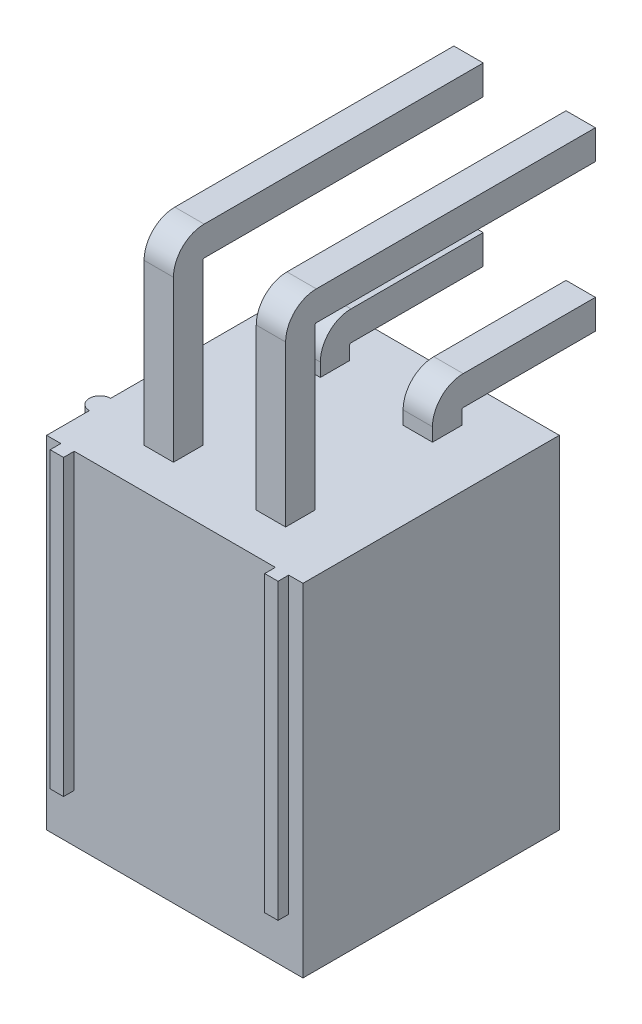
ISO-10303-21;
HEADER;
FILE_DESCRIPTION(('STEP AP214'),'2;1');
FILE_NAME('part.step','',(''),(''),'','','');
FILE_SCHEMA(('AUTOMOTIVE_DESIGN { 1 0 10303 214 1 1 1 1 }'));
ENDSEC;
DATA;
#1=APPLICATION_CONTEXT('core data for automotive mechanical design processes');
#2=APPLICATION_PROTOCOL_DEFINITION('international standard','automotive_design',2000,#1);
#3=PRODUCT_CONTEXT('',#1,'mechanical');
#4=PRODUCT('Part','Part','',(#3));
#5=PRODUCT_RELATED_PRODUCT_CATEGORY('part','',(#4));
#6=PRODUCT_DEFINITION_FORMATION('','',#4);
#7=PRODUCT_DEFINITION_CONTEXT('part definition',#1,'design');
#8=PRODUCT_DEFINITION('design','',#6,#7);
#9=PRODUCT_DEFINITION_SHAPE('','',#8);
#10=(LENGTH_UNIT() NAMED_UNIT(*) SI_UNIT(.MILLI.,.METRE.));
#11=(NAMED_UNIT(*) PLANE_ANGLE_UNIT() SI_UNIT($,.RADIAN.));
#12=(NAMED_UNIT(*) SI_UNIT($,.STERADIAN.) SOLID_ANGLE_UNIT());
#13=UNCERTAINTY_MEASURE_WITH_UNIT(LENGTH_MEASURE(1.E-05),#10,'distance_accuracy_value','');
#14=(GEOMETRIC_REPRESENTATION_CONTEXT(3) GLOBAL_UNCERTAINTY_ASSIGNED_CONTEXT((#13)) GLOBAL_UNIT_ASSIGNED_CONTEXT((#10,
#11,#12)) REPRESENTATION_CONTEXT('',''));
#15=CARTESIAN_POINT('',(0.,0.,0.));
#16=DIRECTION('',(0.,0.,1.));
#17=DIRECTION('',(1.,0.,0.));
#18=AXIS2_PLACEMENT_3D('',#15,#16,#17);
#19=CARTESIAN_POINT('',(2.65,-12.8501,2.15));
#20=DIRECTION('',(0.,0.,1.));
#21=DIRECTION('',(0.,-1.,0.));
#22=AXIS2_PLACEMENT_3D('',#19,#20,#21);
#23=PLANE('',#22);
#24=DIRECTION('',(1.,0.,0.));
#25=VECTOR('',#24,1.);
#26=CARTESIAN_POINT('',(2.65,-7.1501,2.15));
#27=LINE('',#26,#25);
#28=CARTESIAN_POINT('',(2.65,-7.1501,2.15));
#29=VERTEX_POINT('',#28);
#30=CARTESIAN_POINT('',(1.55,-7.1501,2.15));
#31=VERTEX_POINT('',#30);
#32=EDGE_CURVE('E899',#29,#31,#27,.F.);
#33=ORIENTED_EDGE('',*,*,#32,.F.);
#34=DIRECTION('',(0.,1.,0.));
#35=VECTOR('',#34,1.);
#36=CARTESIAN_POINT('',(2.65,0.,2.15));
#37=LINE('',#36,#35);
#38=CARTESIAN_POINT('',(2.65,-12.8501,2.15));
#39=VERTEX_POINT('',#38);
#40=EDGE_CURVE('E889',#39,#29,#37,.T.);
#41=ORIENTED_EDGE('',*,*,#40,.F.);
#42=DIRECTION('',(1.,0.,0.));
#43=VECTOR('',#42,1.);
#44=CARTESIAN_POINT('',(2.65,-12.8501,2.15));
#45=LINE('',#44,#43);
#46=CARTESIAN_POINT('',(1.55,-12.8501,2.15));
#47=VERTEX_POINT('',#46);
#48=EDGE_CURVE('E882',#39,#47,#45,.F.);
#49=ORIENTED_EDGE('',*,*,#48,.T.);
#50=DIRECTION('',(0.,1.,0.));
#51=VECTOR('',#50,1.);
#52=CARTESIAN_POINT('',(1.55,0.,2.15));
#53=LINE('',#52,#51);
#54=EDGE_CURVE('E874',#47,#31,#53,.T.);
#55=ORIENTED_EDGE('',*,*,#54,.T.);
#56=EDGE_LOOP('',(#33,#41,#49,#55));
#57=FACE_BOUND('',#56,.T.);
#58=ADVANCED_FACE('F16',(#57),#23,.F.);
#59=CARTESIAN_POINT('',(2.65,0.,0.));
#60=DIRECTION('',(-1.,0.,0.));
#61=DIRECTION('',(0.,0.,1.));
#62=AXIS2_PLACEMENT_3D('',#59,#60,#61);
#63=PLANE('',#62);
#64=DIRECTION('',(0.,0.,1.));
#65=VECTOR('',#64,1.);
#66=CARTESIAN_POINT('',(2.65,-7.1501,0.));
#67=LINE('',#66,#65);
#68=CARTESIAN_POINT('',(2.65,-7.1501,7.45));
#69=VERTEX_POINT('',#68);
#70=CARTESIAN_POINT('',(2.65,-7.1501,6.35));
#71=VERTEX_POINT('',#70);
#72=EDGE_CURVE('E897',#69,#71,#67,.F.);
#73=ORIENTED_EDGE('',*,*,#72,.F.);
#74=DIRECTION('',(0.,1.,0.));
#75=VECTOR('',#74,1.);
#76=CARTESIAN_POINT('',(2.65,-12.8501,7.45));
#77=LINE('',#76,#75);
#78=CARTESIAN_POINT('',(2.65,-12.8501,7.45));
#79=VERTEX_POINT('',#78);
#80=EDGE_CURVE('E857',#69,#79,#77,.F.);
#81=ORIENTED_EDGE('',*,*,#80,.T.);
#82=DIRECTION('',(0.,0.,1.));
#83=VECTOR('',#82,1.);
#84=CARTESIAN_POINT('',(2.65,-12.8501,7.45));
#85=LINE('',#84,#83);
#86=CARTESIAN_POINT('',(2.65,-12.8501,6.35));
#87=VERTEX_POINT('',#86);
#88=EDGE_CURVE('E866',#79,#87,#85,.F.);
#89=ORIENTED_EDGE('',*,*,#88,.T.);
#90=DIRECTION('',(0.,1.,0.));
#91=VECTOR('',#90,1.);
#92=CARTESIAN_POINT('',(2.65,-12.8501,6.35));
#93=LINE('',#92,#91);
#94=EDGE_CURVE('E871',#87,#71,#93,.T.);
#95=ORIENTED_EDGE('',*,*,#94,.T.);
#96=EDGE_LOOP('',(#73,#81,#89,#95));
#97=FACE_BOUND('',#96,.T.);
#98=ADVANCED_FACE('F1730',(#97),#63,.F.);
#99=CARTESIAN_POINT('',(-1.55,-12.8501,2.15));
#100=DIRECTION('',(0.,0.,1.));
#101=DIRECTION('',(0.,-1.,0.));
#102=AXIS2_PLACEMENT_3D('',#99,#100,#101);
#103=PLANE('',#102);
#104=DIRECTION('',(1.,0.,0.));
#105=VECTOR('',#104,1.);
#106=CARTESIAN_POINT('',(-1.55,-7.1501,2.15));
#107=LINE('',#106,#105);
#108=CARTESIAN_POINT('',(-1.55,-7.1501,2.15));
#109=VERTEX_POINT('',#108);
#110=CARTESIAN_POINT('',(-2.65,-7.1501,2.15));
#111=VERTEX_POINT('',#110);
#112=EDGE_CURVE('E894',#109,#111,#107,.F.);
#113=ORIENTED_EDGE('',*,*,#112,.F.);
#114=DIRECTION('',(0.,1.,0.));
#115=VECTOR('',#114,1.);
#116=CARTESIAN_POINT('',(-1.55,0.,2.15));
#117=LINE('',#116,#115);
#118=CARTESIAN_POINT('',(-1.55,-12.8501,2.15));
#119=VERTEX_POINT('',#118);
#120=EDGE_CURVE('E851',#119,#109,#117,.T.);
#121=ORIENTED_EDGE('',*,*,#120,.F.);
#122=DIRECTION('',(1.,0.,0.));
#123=VECTOR('',#122,1.);
#124=CARTESIAN_POINT('',(-1.55,-12.8501,2.15));
#125=LINE('',#124,#123);
#126=CARTESIAN_POINT('',(-2.65,-12.8501,2.15));
#127=VERTEX_POINT('',#126);
#128=EDGE_CURVE('E844',#119,#127,#125,.F.);
#129=ORIENTED_EDGE('',*,*,#128,.T.);
#130=DIRECTION('',(0.,1.,0.));
#131=VECTOR('',#130,1.);
#132=CARTESIAN_POINT('',(-2.65,0.,2.15));
#133=LINE('',#132,#131);
#134=EDGE_CURVE('E836',#127,#111,#133,.T.);
#135=ORIENTED_EDGE('',*,*,#134,.T.);
#136=EDGE_LOOP('',(#113,#121,#129,#135));
#137=FACE_BOUND('',#136,.T.);
#138=ADVANCED_FACE('F1727',(#137),#103,.F.);
#139=CARTESIAN_POINT('',(-1.55,0.,0.));
#140=DIRECTION('',(-1.,0.,0.));
#141=DIRECTION('',(0.,0.,1.));
#142=AXIS2_PLACEMENT_3D('',#139,#140,#141);
#143=PLANE('',#142);
#144=DIRECTION('',(0.,0.,1.));
#145=VECTOR('',#144,1.);
#146=CARTESIAN_POINT('',(-1.55,-7.1501,0.));
#147=LINE('',#146,#145);
#148=CARTESIAN_POINT('',(-1.55,-7.1501,7.45));
#149=VERTEX_POINT('',#148);
#150=CARTESIAN_POINT('',(-1.55,-7.1501,6.35));
#151=VERTEX_POINT('',#150);
#152=EDGE_CURVE('E892',#149,#151,#147,.F.);
#153=ORIENTED_EDGE('',*,*,#152,.F.);
#154=DIRECTION('',(0.,1.,0.));
#155=VECTOR('',#154,1.);
#156=CARTESIAN_POINT('',(-1.55,-12.8501,7.45));
#157=LINE('',#156,#155);
#158=CARTESIAN_POINT('',(-1.55,-12.8501,7.45));
#159=VERTEX_POINT('',#158);
#160=EDGE_CURVE('E819',#149,#159,#157,.F.);
#161=ORIENTED_EDGE('',*,*,#160,.T.);
#162=DIRECTION('',(0.,0.,1.));
#163=VECTOR('',#162,1.);
#164=CARTESIAN_POINT('',(-1.55,-12.8501,7.45));
#165=LINE('',#164,#163);
#166=CARTESIAN_POINT('',(-1.55,-12.8501,6.35));
#167=VERTEX_POINT('',#166);
#168=EDGE_CURVE('E828',#159,#167,#165,.F.);
#169=ORIENTED_EDGE('',*,*,#168,.T.);
#170=DIRECTION('',(0.,1.,0.));
#171=VECTOR('',#170,1.);
#172=CARTESIAN_POINT('',(-1.55,-12.8501,6.35));
#173=LINE('',#172,#171);
#174=EDGE_CURVE('E833',#167,#151,#173,.T.);
#175=ORIENTED_EDGE('',*,*,#174,.T.);
#176=EDGE_LOOP('',(#153,#161,#169,#175));
#177=FACE_BOUND('',#176,.T.);
#178=ADVANCED_FACE('F1723',(#177),#143,.F.);
#179=CARTESIAN_POINT('',(2.65,0.,0.));
#180=DIRECTION('',(1.,0.,0.));
#181=DIRECTION('',(0.,0.,-1.));
#182=AXIS2_PLACEMENT_3D('',#179,#180,#181);
#183=PLANE('',#182);
#184=DIRECTION('',(0.,1.,0.));
#185=VECTOR('',#184,1.);
#186=CARTESIAN_POINT('',(2.65,-12.8501,3.25));
#187=LINE('',#186,#185);
#188=CARTESIAN_POINT('',(2.65,-7.1501,3.25));
#189=VERTEX_POINT('',#188);
#190=CARTESIAN_POINT('',(2.65,-12.8501,3.25));
#191=VERTEX_POINT('',#190);
#192=EDGE_CURVE('E807',#189,#191,#187,.F.);
#193=ORIENTED_EDGE('',*,*,#192,.T.);
#194=DIRECTION('',(0.,0.,1.));
#195=VECTOR('',#194,1.);
#196=CARTESIAN_POINT('',(2.65,-12.8501,2.15));
#197=LINE('',#196,#195);
#198=EDGE_CURVE('E884',#191,#39,#197,.F.);
#199=ORIENTED_EDGE('',*,*,#198,.T.);
#200=ORIENTED_EDGE('',*,*,#40,.T.);
#201=DIRECTION('',(0.,0.,-1.));
#202=VECTOR('',#201,1.);
#203=CARTESIAN_POINT('',(2.65,-7.1501,0.));
#204=LINE('',#203,#202);
#205=EDGE_CURVE('E887',#29,#189,#204,.F.);
#206=ORIENTED_EDGE('',*,*,#205,.T.);
#207=EDGE_LOOP('',(#193,#199,#200,#206));
#208=FACE_BOUND('',#207,.T.);
#209=ADVANCED_FACE('F1719',(#208),#183,.T.);
#210=CARTESIAN_POINT('',(2.65,-12.8501,2.15));
#211=DIRECTION('',(0.,1.,0.));
#212=DIRECTION('',(0.,0.,1.));
#213=AXIS2_PLACEMENT_3D('',#210,#211,#212);
#214=PLANE('',#213);
#215=ORIENTED_EDGE('',*,*,#48,.F.);
#216=ORIENTED_EDGE('',*,*,#198,.F.);
#217=DIRECTION('',(1.,0.,0.));
#218=VECTOR('',#217,1.);
#219=CARTESIAN_POINT('',(2.65,-12.8501,3.25));
#220=LINE('',#219,#218);
#221=CARTESIAN_POINT('',(1.55,-12.8501,3.25));
#222=VERTEX_POINT('',#221);
#223=EDGE_CURVE('E804',#191,#222,#220,.F.);
#224=ORIENTED_EDGE('',*,*,#223,.T.);
#225=DIRECTION('',(0.,0.,-1.));
#226=VECTOR('',#225,1.);
#227=CARTESIAN_POINT('',(1.55,-12.8501,0.));
#228=LINE('',#227,#226);
#229=EDGE_CURVE('E877',#222,#47,#228,.T.);
#230=ORIENTED_EDGE('',*,*,#229,.T.);
#231=EDGE_LOOP('',(#215,#216,#224,#230));
#232=FACE_BOUND('',#231,.T.);
#233=ADVANCED_FACE('F1715',(#232),#214,.F.);
#234=CARTESIAN_POINT('',(1.55,0.,0.));
#235=DIRECTION('',(1.,0.,0.));
#236=DIRECTION('',(0.,0.,-1.));
#237=AXIS2_PLACEMENT_3D('',#234,#235,#236);
#238=PLANE('',#237);
#239=ORIENTED_EDGE('',*,*,#229,.F.);
#240=DIRECTION('',(0.,1.,0.));
#241=VECTOR('',#240,1.);
#242=CARTESIAN_POINT('',(1.55,-12.8501,3.25));
#243=LINE('',#242,#241);
#244=CARTESIAN_POINT('',(1.55,-7.1501,3.25));
#245=VERTEX_POINT('',#244);
#246=EDGE_CURVE('E801',#222,#245,#243,.T.);
#247=ORIENTED_EDGE('',*,*,#246,.T.);
#248=DIRECTION('',(0.,0.,-1.));
#249=VECTOR('',#248,1.);
#250=CARTESIAN_POINT('',(1.55,-7.1501,0.));
#251=LINE('',#250,#249);
#252=EDGE_CURVE('E880',#31,#245,#251,.F.);
#253=ORIENTED_EDGE('',*,*,#252,.F.);
#254=ORIENTED_EDGE('',*,*,#54,.F.);
#255=EDGE_LOOP('',(#239,#247,#253,#254));
#256=FACE_BOUND('',#255,.T.);
#257=ADVANCED_FACE('F1711',(#256),#238,.F.);
#258=CARTESIAN_POINT('',(2.65,-12.8501,6.35));
#259=DIRECTION('',(0.,0.,1.));
#260=DIRECTION('',(1.,0.,0.));
#261=AXIS2_PLACEMENT_3D('',#258,#259,#260);
#262=PLANE('',#261);
#263=DIRECTION('',(1.,0.,0.));
#264=VECTOR('',#263,1.);
#265=CARTESIAN_POINT('',(2.65,-7.1501,6.35));
#266=LINE('',#265,#264);
#267=CARTESIAN_POINT('',(1.55,-7.1501,6.35));
#268=VERTEX_POINT('',#267);
#269=EDGE_CURVE('E869',#71,#268,#266,.F.);
#270=ORIENTED_EDGE('',*,*,#269,.F.);
#271=ORIENTED_EDGE('',*,*,#94,.F.);
#272=DIRECTION('',(1.,0.,0.));
#273=VECTOR('',#272,1.);
#274=CARTESIAN_POINT('',(2.65,-12.8501,6.35));
#275=LINE('',#274,#273);
#276=CARTESIAN_POINT('',(1.55,-12.8501,6.35));
#277=VERTEX_POINT('',#276);
#278=EDGE_CURVE('E863',#87,#277,#275,.F.);
#279=ORIENTED_EDGE('',*,*,#278,.T.);
#280=DIRECTION('',(0.,1.,0.));
#281=VECTOR('',#280,1.);
#282=CARTESIAN_POINT('',(1.55,0.,6.35));
#283=LINE('',#282,#281);
#284=EDGE_CURVE('E799',#268,#277,#283,.F.);
#285=ORIENTED_EDGE('',*,*,#284,.F.);
#286=EDGE_LOOP('',(#270,#271,#279,#285));
#287=FACE_BOUND('',#286,.T.);
#288=ADVANCED_FACE('F1707',(#287),#262,.F.);
#289=CARTESIAN_POINT('',(2.65,-12.8501,7.45));
#290=DIRECTION('',(0.,1.,0.));
#291=DIRECTION('',(0.,0.,1.));
#292=AXIS2_PLACEMENT_3D('',#289,#290,#291);
#293=PLANE('',#292);
#294=ORIENTED_EDGE('',*,*,#278,.F.);
#295=ORIENTED_EDGE('',*,*,#88,.F.);
#296=DIRECTION('',(-1.,0.,0.));
#297=VECTOR('',#296,1.);
#298=CARTESIAN_POINT('',(2.65,-12.8501,7.45));
#299=LINE('',#298,#297);
#300=CARTESIAN_POINT('',(1.55,-12.8501,7.45));
#301=VERTEX_POINT('',#300);
#302=EDGE_CURVE('E854',#79,#301,#299,.T.);
#303=ORIENTED_EDGE('',*,*,#302,.T.);
#304=DIRECTION('',(0.,0.,1.));
#305=VECTOR('',#304,1.);
#306=CARTESIAN_POINT('',(1.55,-12.8501,0.));
#307=LINE('',#306,#305);
#308=EDGE_CURVE('E797',#277,#301,#307,.T.);
#309=ORIENTED_EDGE('',*,*,#308,.F.);
#310=EDGE_LOOP('',(#294,#295,#303,#309));
#311=FACE_BOUND('',#310,.T.);
#312=ADVANCED_FACE('F1703',(#311),#293,.F.);
#313=CARTESIAN_POINT('',(2.65,-12.8501,7.45));
#314=DIRECTION('',(0.,0.,-1.));
#315=DIRECTION('',(-1.,0.,0.));
#316=AXIS2_PLACEMENT_3D('',#313,#314,#315);
#317=PLANE('',#316);
#318=ORIENTED_EDGE('',*,*,#302,.F.);
#319=ORIENTED_EDGE('',*,*,#80,.F.);
#320=DIRECTION('',(-1.,0.,0.));
#321=VECTOR('',#320,1.);
#322=CARTESIAN_POINT('',(2.65,-7.1501,7.45));
#323=LINE('',#322,#321);
#324=CARTESIAN_POINT('',(1.55,-7.1501,7.45));
#325=VERTEX_POINT('',#324);
#326=EDGE_CURVE('E860',#325,#69,#323,.F.);
#327=ORIENTED_EDGE('',*,*,#326,.F.);
#328=DIRECTION('',(0.,1.,0.));
#329=VECTOR('',#328,1.);
#330=CARTESIAN_POINT('',(1.55,0.,7.45));
#331=LINE('',#330,#329);
#332=EDGE_CURVE('E794',#301,#325,#331,.T.);
#333=ORIENTED_EDGE('',*,*,#332,.F.);
#334=EDGE_LOOP('',(#318,#319,#327,#333));
#335=FACE_BOUND('',#334,.T.);
#336=ADVANCED_FACE('F1699',(#335),#317,.F.);
#337=CARTESIAN_POINT('',(-1.55,0.,0.));
#338=DIRECTION('',(1.,0.,0.));
#339=DIRECTION('',(0.,0.,-1.));
#340=AXIS2_PLACEMENT_3D('',#337,#338,#339);
#341=PLANE('',#340);
#342=DIRECTION('',(0.,1.,0.));
#343=VECTOR('',#342,1.);
#344=CARTESIAN_POINT('',(-1.55,-12.8501,3.25));
#345=LINE('',#344,#343);
#346=CARTESIAN_POINT('',(-1.55,-7.1501,3.25));
#347=VERTEX_POINT('',#346);
#348=CARTESIAN_POINT('',(-1.55,-12.8501,3.25));
#349=VERTEX_POINT('',#348);
#350=EDGE_CURVE('E791',#347,#349,#345,.F.);
#351=ORIENTED_EDGE('',*,*,#350,.T.);
#352=DIRECTION('',(0.,0.,1.));
#353=VECTOR('',#352,1.);
#354=CARTESIAN_POINT('',(-1.55,-12.8501,2.15));
#355=LINE('',#354,#353);
#356=EDGE_CURVE('E846',#349,#119,#355,.F.);
#357=ORIENTED_EDGE('',*,*,#356,.T.);
#358=ORIENTED_EDGE('',*,*,#120,.T.);
#359=DIRECTION('',(0.,0.,-1.));
#360=VECTOR('',#359,1.);
#361=CARTESIAN_POINT('',(-1.55,-7.1501,0.));
#362=LINE('',#361,#360);
#363=EDGE_CURVE('E849',#109,#347,#362,.F.);
#364=ORIENTED_EDGE('',*,*,#363,.T.);
#365=EDGE_LOOP('',(#351,#357,#358,#364));
#366=FACE_BOUND('',#365,.T.);
#367=ADVANCED_FACE('F1695',(#366),#341,.T.);
#368=CARTESIAN_POINT('',(-1.55,-12.8501,2.15));
#369=DIRECTION('',(0.,1.,0.));
#370=DIRECTION('',(0.,0.,1.));
#371=AXIS2_PLACEMENT_3D('',#368,#369,#370);
#372=PLANE('',#371);
#373=ORIENTED_EDGE('',*,*,#128,.F.);
#374=ORIENTED_EDGE('',*,*,#356,.F.);
#375=DIRECTION('',(1.,0.,0.));
#376=VECTOR('',#375,1.);
#377=CARTESIAN_POINT('',(-1.55,-12.8501,3.25));
#378=LINE('',#377,#376);
#379=CARTESIAN_POINT('',(-2.65,-12.8501,3.25));
#380=VERTEX_POINT('',#379);
#381=EDGE_CURVE('E788',#349,#380,#378,.F.);
#382=ORIENTED_EDGE('',*,*,#381,.T.);
#383=DIRECTION('',(0.,0.,-1.));
#384=VECTOR('',#383,1.);
#385=CARTESIAN_POINT('',(-2.65,-12.8501,0.));
#386=LINE('',#385,#384);
#387=EDGE_CURVE('E839',#380,#127,#386,.T.);
#388=ORIENTED_EDGE('',*,*,#387,.T.);
#389=EDGE_LOOP('',(#373,#374,#382,#388));
#390=FACE_BOUND('',#389,.T.);
#391=ADVANCED_FACE('F1691',(#390),#372,.F.);
#392=CARTESIAN_POINT('',(-2.65,0.,0.));
#393=DIRECTION('',(1.,0.,0.));
#394=DIRECTION('',(0.,0.,-1.));
#395=AXIS2_PLACEMENT_3D('',#392,#393,#394);
#396=PLANE('',#395);
#397=ORIENTED_EDGE('',*,*,#387,.F.);
#398=DIRECTION('',(0.,1.,0.));
#399=VECTOR('',#398,1.);
#400=CARTESIAN_POINT('',(-2.65,-12.8501,3.25));
#401=LINE('',#400,#399);
#402=CARTESIAN_POINT('',(-2.65,-7.1501,3.25));
#403=VERTEX_POINT('',#402);
#404=EDGE_CURVE('E785',#380,#403,#401,.T.);
#405=ORIENTED_EDGE('',*,*,#404,.T.);
#406=DIRECTION('',(0.,0.,-1.));
#407=VECTOR('',#406,1.);
#408=CARTESIAN_POINT('',(-2.65,-7.1501,0.));
#409=LINE('',#408,#407);
#410=EDGE_CURVE('E842',#111,#403,#409,.F.);
#411=ORIENTED_EDGE('',*,*,#410,.F.);
#412=ORIENTED_EDGE('',*,*,#134,.F.);
#413=EDGE_LOOP('',(#397,#405,#411,#412));
#414=FACE_BOUND('',#413,.T.);
#415=ADVANCED_FACE('F1687',(#414),#396,.F.);
#416=CARTESIAN_POINT('',(-1.55,-12.8501,6.35));
#417=DIRECTION('',(0.,0.,1.));
#418=DIRECTION('',(1.,0.,0.));
#419=AXIS2_PLACEMENT_3D('',#416,#417,#418);
#420=PLANE('',#419);
#421=DIRECTION('',(1.,0.,0.));
#422=VECTOR('',#421,1.);
#423=CARTESIAN_POINT('',(-1.55,-7.1501,6.35));
#424=LINE('',#423,#422);
#425=CARTESIAN_POINT('',(-2.65,-7.1501,6.35));
#426=VERTEX_POINT('',#425);
#427=EDGE_CURVE('E831',#151,#426,#424,.F.);
#428=ORIENTED_EDGE('',*,*,#427,.F.);
#429=ORIENTED_EDGE('',*,*,#174,.F.);
#430=DIRECTION('',(1.,0.,0.));
#431=VECTOR('',#430,1.);
#432=CARTESIAN_POINT('',(-1.55,-12.8501,6.35));
#433=LINE('',#432,#431);
#434=CARTESIAN_POINT('',(-2.65,-12.8501,6.35));
#435=VERTEX_POINT('',#434);
#436=EDGE_CURVE('E825',#167,#435,#433,.F.);
#437=ORIENTED_EDGE('',*,*,#436,.T.);
#438=DIRECTION('',(0.,1.,0.));
#439=VECTOR('',#438,1.);
#440=CARTESIAN_POINT('',(-2.65,0.,6.35));
#441=LINE('',#440,#439);
#442=EDGE_CURVE('E783',#426,#435,#441,.F.);
#443=ORIENTED_EDGE('',*,*,#442,.F.);
#444=EDGE_LOOP('',(#428,#429,#437,#443));
#445=FACE_BOUND('',#444,.T.);
#446=ADVANCED_FACE('F1683',(#445),#420,.F.);
#447=CARTESIAN_POINT('',(-1.55,-12.8501,7.45));
#448=DIRECTION('',(0.,1.,0.));
#449=DIRECTION('',(0.,0.,1.));
#450=AXIS2_PLACEMENT_3D('',#447,#448,#449);
#451=PLANE('',#450);
#452=ORIENTED_EDGE('',*,*,#436,.F.);
#453=ORIENTED_EDGE('',*,*,#168,.F.);
#454=DIRECTION('',(-1.,0.,0.));
#455=VECTOR('',#454,1.);
#456=CARTESIAN_POINT('',(-1.55,-12.8501,7.45));
#457=LINE('',#456,#455);
#458=CARTESIAN_POINT('',(-2.65,-12.8501,7.45));
#459=VERTEX_POINT('',#458);
#460=EDGE_CURVE('E810',#159,#459,#457,.T.);
#461=ORIENTED_EDGE('',*,*,#460,.T.);
#462=DIRECTION('',(0.,0.,1.));
#463=VECTOR('',#462,1.);
#464=CARTESIAN_POINT('',(-2.65,-12.8501,0.));
#465=LINE('',#464,#463);
#466=EDGE_CURVE('E781',#435,#459,#465,.T.);
#467=ORIENTED_EDGE('',*,*,#466,.F.);
#468=EDGE_LOOP('',(#452,#453,#461,#467));
#469=FACE_BOUND('',#468,.T.);
#470=ADVANCED_FACE('F1679',(#469),#451,.F.);
#471=CARTESIAN_POINT('',(-1.55,-12.8501,7.45));
#472=DIRECTION('',(0.,0.,-1.));
#473=DIRECTION('',(-1.,0.,0.));
#474=AXIS2_PLACEMENT_3D('',#471,#472,#473);
#475=PLANE('',#474);
#476=ORIENTED_EDGE('',*,*,#460,.F.);
#477=ORIENTED_EDGE('',*,*,#160,.F.);
#478=DIRECTION('',(-1.,0.,0.));
#479=VECTOR('',#478,1.);
#480=CARTESIAN_POINT('',(-1.55,-7.1501,7.45));
#481=LINE('',#480,#479);
#482=CARTESIAN_POINT('',(-2.65,-7.1501,7.45));
#483=VERTEX_POINT('',#482);
#484=EDGE_CURVE('E822',#483,#149,#481,.F.);
#485=ORIENTED_EDGE('',*,*,#484,.F.);
#486=DIRECTION('',(0.,1.,0.));
#487=VECTOR('',#486,1.);
#488=CARTESIAN_POINT('',(-2.65,0.,7.45));
#489=LINE('',#488,#487);
#490=EDGE_CURVE('E771',#459,#483,#489,.T.);
#491=ORIENTED_EDGE('',*,*,#490,.F.);
#492=EDGE_LOOP('',(#476,#477,#485,#491));
#493=FACE_BOUND('',#492,.T.);
#494=ADVANCED_FACE('F1675',(#493),#475,.F.);
#495=CARTESIAN_POINT('',(2.65,-12.8501,3.25));
#496=DIRECTION('',(0.,0.,-1.));
#497=DIRECTION('',(0.,1.,0.));
#498=AXIS2_PLACEMENT_3D('',#495,#496,#497);
#499=PLANE('',#498);
#500=ORIENTED_EDGE('',*,*,#223,.F.);
#501=ORIENTED_EDGE('',*,*,#192,.F.);
#502=DIRECTION('',(1.,0.,0.));
#503=VECTOR('',#502,1.);
#504=CARTESIAN_POINT('',(0.,-7.1501,3.25));
#505=LINE('',#504,#503);
#506=EDGE_CURVE('E670',#189,#245,#505,.F.);
#507=ORIENTED_EDGE('',*,*,#506,.T.);
#508=ORIENTED_EDGE('',*,*,#246,.F.);
#509=EDGE_LOOP('',(#500,#501,#507,#508));
#510=FACE_BOUND('',#509,.T.);
#511=ADVANCED_FACE('F1671',(#510),#499,.F.);
#512=CARTESIAN_POINT('',(1.55,0.,0.));
#513=DIRECTION('',(-1.,0.,0.));
#514=DIRECTION('',(0.,0.,1.));
#515=AXIS2_PLACEMENT_3D('',#512,#513,#514);
#516=PLANE('',#515);
#517=ORIENTED_EDGE('',*,*,#332,.T.);
#518=DIRECTION('',(0.,0.,-1.));
#519=VECTOR('',#518,1.);
#520=CARTESIAN_POINT('',(1.55,-7.1501,0.));
#521=LINE('',#520,#519);
#522=EDGE_CURVE('E667',#268,#325,#521,.F.);
#523=ORIENTED_EDGE('',*,*,#522,.F.);
#524=ORIENTED_EDGE('',*,*,#284,.T.);
#525=ORIENTED_EDGE('',*,*,#308,.T.);
#526=EDGE_LOOP('',(#517,#523,#524,#525));
#527=FACE_BOUND('',#526,.T.);
#528=ADVANCED_FACE('F1667',(#527),#516,.T.);
#529=CARTESIAN_POINT('',(-1.55,-12.8501,3.25));
#530=DIRECTION('',(0.,0.,-1.));
#531=DIRECTION('',(0.,1.,0.));
#532=AXIS2_PLACEMENT_3D('',#529,#530,#531);
#533=PLANE('',#532);
#534=ORIENTED_EDGE('',*,*,#381,.F.);
#535=ORIENTED_EDGE('',*,*,#350,.F.);
#536=DIRECTION('',(1.,0.,0.));
#537=VECTOR('',#536,1.);
#538=CARTESIAN_POINT('',(0.,-7.1501,3.25));
#539=LINE('',#538,#537);
#540=EDGE_CURVE('E664',#347,#403,#539,.F.);
#541=ORIENTED_EDGE('',*,*,#540,.T.);
#542=ORIENTED_EDGE('',*,*,#404,.F.);
#543=EDGE_LOOP('',(#534,#535,#541,#542));
#544=FACE_BOUND('',#543,.T.);
#545=ADVANCED_FACE('F1663',(#544),#533,.F.);
#546=CARTESIAN_POINT('',(-2.65,0.,0.));
#547=DIRECTION('',(-1.,0.,0.));
#548=DIRECTION('',(0.,0.,1.));
#549=AXIS2_PLACEMENT_3D('',#546,#547,#548);
#550=PLANE('',#549);
#551=ORIENTED_EDGE('',*,*,#490,.T.);
#552=DIRECTION('',(0.,0.,-1.));
#553=VECTOR('',#552,1.);
#554=CARTESIAN_POINT('',(-2.65,-7.1501,0.));
#555=LINE('',#554,#553);
#556=EDGE_CURVE('E661',#426,#483,#555,.F.);
#557=ORIENTED_EDGE('',*,*,#556,.F.);
#558=ORIENTED_EDGE('',*,*,#442,.T.);
#559=ORIENTED_EDGE('',*,*,#466,.T.);
#560=EDGE_LOOP('',(#551,#557,#558,#559));
#561=FACE_BOUND('',#560,.T.);
#562=ADVANCED_FACE('F1659',(#561),#550,.T.);
#563=CARTESIAN_POINT('',(-1.55,2.2,6.95));
#564=DIRECTION('',(0.,1.,0.));
#565=DIRECTION('',(0.,0.,1.));
#566=AXIS2_PLACEMENT_3D('',#563,#564,#565);
#567=PLANE('',#566);
#568=DIRECTION('',(1.,0.,0.));
#569=VECTOR('',#568,1.);
#570=CARTESIAN_POINT('',(-1.55,2.2,-3.5));
#571=LINE('',#570,#569);
#572=CARTESIAN_POINT('',(-2.65,2.2,-3.5));
#573=VERTEX_POINT('',#572);
#574=CARTESIAN_POINT('',(-1.55,2.2,-3.5));
#575=VERTEX_POINT('',#574);
#576=EDGE_CURVE('E762',#573,#575,#571,.T.);
#577=ORIENTED_EDGE('',*,*,#576,.T.);
#578=DIRECTION('',(0.,0.,-1.));
#579=VECTOR('',#578,1.);
#580=CARTESIAN_POINT('',(-1.55,2.2,6.95));
#581=LINE('',#580,#579);
#582=CARTESIAN_POINT('',(-1.55,2.2,6.95));
#583=VERTEX_POINT('',#582);
#584=EDGE_CURVE('E636',#583,#575,#581,.T.);
#585=ORIENTED_EDGE('',*,*,#584,.F.);
#586=DIRECTION('',(-1.,0.,0.));
#587=VECTOR('',#586,1.);
#588=CARTESIAN_POINT('',(-1.55,2.2,6.95));
#589=LINE('',#588,#587);
#590=CARTESIAN_POINT('',(-2.65,2.2,6.95));
#591=VERTEX_POINT('',#590);
#592=EDGE_CURVE('E774',#583,#591,#589,.T.);
#593=ORIENTED_EDGE('',*,*,#592,.T.);
#594=DIRECTION('',(0.,0.,-1.));
#595=VECTOR('',#594,1.);
#596=CARTESIAN_POINT('',(-2.65,2.2,6.95));
#597=LINE('',#596,#595);
#598=EDGE_CURVE('E595',#591,#573,#597,.T.);
#599=ORIENTED_EDGE('',*,*,#598,.T.);
#600=EDGE_LOOP('',(#577,#585,#593,#599));
#601=FACE_BOUND('',#600,.T.);
#602=ADVANCED_FACE('F1655',(#601),#567,.F.);
#603=CARTESIAN_POINT('',(-1.55,2.2,-3.5));
#604=DIRECTION('',(0.,0.,1.));
#605=DIRECTION('',(1.,0.,0.));
#606=AXIS2_PLACEMENT_3D('',#603,#604,#605);
#607=PLANE('',#606);
#608=DIRECTION('',(1.,0.,0.));
#609=VECTOR('',#608,1.);
#610=CARTESIAN_POINT('',(-1.55,3.3,-3.5));
#611=LINE('',#610,#609);
#612=CARTESIAN_POINT('',(-2.65,3.3,-3.5));
#613=VERTEX_POINT('',#612);
#614=CARTESIAN_POINT('',(-1.55,3.3,-3.5));
#615=VERTEX_POINT('',#614);
#616=EDGE_CURVE('E759',#613,#615,#611,.T.);
#617=ORIENTED_EDGE('',*,*,#616,.T.);
#618=DIRECTION('',(0.,1.,0.));
#619=VECTOR('',#618,1.);
#620=CARTESIAN_POINT('',(-1.55,2.15,-3.5));
#621=LINE('',#620,#619);
#622=EDGE_CURVE('E633',#575,#615,#621,.T.);
#623=ORIENTED_EDGE('',*,*,#622,.F.);
#624=ORIENTED_EDGE('',*,*,#576,.F.);
#625=DIRECTION('',(0.,1.,0.));
#626=VECTOR('',#625,1.);
#627=CARTESIAN_POINT('',(-2.65,2.15,-3.5));
#628=LINE('',#627,#626);
#629=EDGE_CURVE('E592',#573,#613,#628,.T.);
#630=ORIENTED_EDGE('',*,*,#629,.T.);
#631=EDGE_LOOP('',(#617,#623,#624,#630));
#632=FACE_BOUND('',#631,.T.);
#633=ADVANCED_FACE('F1651',(#632),#607,.F.);
#634=CARTESIAN_POINT('',(-1.55,3.3,6.94999999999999));
#635=DIRECTION('',(0.,-1.,0.));
#636=DIRECTION('',(0.,0.,-1.));
#637=AXIS2_PLACEMENT_3D('',#634,#635,#636);
#638=PLANE('',#637);
#639=DIRECTION('',(-1.,0.,0.));
#640=VECTOR('',#639,1.);
#641=CARTESIAN_POINT('',(-1.55,3.3,6.94999999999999));
#642=LINE('',#641,#640);
#643=CARTESIAN_POINT('',(-1.55,3.3,6.95));
#644=VERTEX_POINT('',#643);
#645=CARTESIAN_POINT('',(-2.65,3.3,6.95));
#646=VERTEX_POINT('',#645);
#647=EDGE_CURVE('E754',#644,#646,#642,.T.);
#648=ORIENTED_EDGE('',*,*,#647,.F.);
#649=DIRECTION('',(0.,0.,-1.));
#650=VECTOR('',#649,1.);
#651=CARTESIAN_POINT('',(-1.55,3.3,6.95));
#652=LINE('',#651,#650);
#653=EDGE_CURVE('E631',#615,#644,#652,.F.);
#654=ORIENTED_EDGE('',*,*,#653,.F.);
#655=ORIENTED_EDGE('',*,*,#616,.F.);
#656=DIRECTION('',(0.,0.,-1.));
#657=VECTOR('',#656,1.);
#658=CARTESIAN_POINT('',(-2.65,3.3,6.95));
#659=LINE('',#658,#657);
#660=EDGE_CURVE('E589',#613,#646,#659,.F.);
#661=ORIENTED_EDGE('',*,*,#660,.T.);
#662=EDGE_LOOP('',(#648,#654,#655,#661));
#663=FACE_BOUND('',#662,.T.);
#664=ADVANCED_FACE('F1647',(#663),#638,.F.);
#665=CARTESIAN_POINT('',(-1.55,2.15,6.95));
#666=DIRECTION('',(-1.,0.,0.));
#667=DIRECTION('',(0.,0.,1.));
#668=AXIS2_PLACEMENT_3D('',#665,#666,#667);
#669=CYLINDRICAL_SURFACE('',#668,1.15);
#670=CARTESIAN_POINT('',(-1.55,2.15,6.95));
#671=DIRECTION('',(-1.,0.,0.));
#672=DIRECTION('',(0.,0.,1.));
#673=AXIS2_PLACEMENT_3D('',#670,#671,#672);
#674=CIRCLE('',#673,1.15);
#675=CARTESIAN_POINT('',(-1.55,2.15,8.1));
#676=VERTEX_POINT('',#675);
#677=EDGE_CURVE('E628',#644,#676,#674,.F.);
#678=ORIENTED_EDGE('',*,*,#677,.F.);
#679=ORIENTED_EDGE('',*,*,#647,.T.);
#680=CARTESIAN_POINT('',(-2.65,2.15,6.95));
#681=DIRECTION('',(-1.,0.,0.));
#682=DIRECTION('',(0.,0.,1.));
#683=AXIS2_PLACEMENT_3D('',#680,#681,#682);
#684=CIRCLE('',#683,1.15);
#685=CARTESIAN_POINT('',(-2.65,2.15,8.1));
#686=VERTEX_POINT('',#685);
#687=EDGE_CURVE('E586',#646,#686,#684,.F.);
#688=ORIENTED_EDGE('',*,*,#687,.T.);
#689=DIRECTION('',(-1.,0.,0.));
#690=VECTOR('',#689,1.);
#691=CARTESIAN_POINT('',(-1.55,2.15,8.1));
#692=LINE('',#691,#690);
#693=EDGE_CURVE('E750',#686,#676,#692,.F.);
#694=ORIENTED_EDGE('',*,*,#693,.T.);
#695=EDGE_LOOP('',(#678,#679,#688,#694));
#696=FACE_BOUND('',#695,.T.);
#697=ADVANCED_FACE('F1643',(#696),#669,.T.);
#698=CARTESIAN_POINT('',(-1.55,-3.8501,8.1));
#699=DIRECTION('',(0.,0.,-1.));
#700=DIRECTION('',(-1.,0.,0.));
#701=AXIS2_PLACEMENT_3D('',#698,#699,#700);
#702=PLANE('',#701);
#703=DIRECTION('',(-1.,0.,0.));
#704=VECTOR('',#703,1.);
#705=CARTESIAN_POINT('',(-1.55,-3.8501,8.1));
#706=LINE('',#705,#704);
#707=CARTESIAN_POINT('',(-1.55,-3.8501,8.1));
#708=VERTEX_POINT('',#707);
#709=CARTESIAN_POINT('',(-2.65,-3.8501,8.1));
#710=VERTEX_POINT('',#709);
#711=EDGE_CURVE('E753',#708,#710,#706,.T.);
#712=ORIENTED_EDGE('',*,*,#711,.F.);
#713=DIRECTION('',(0.,1.,0.));
#714=VECTOR('',#713,1.);
#715=CARTESIAN_POINT('',(-1.55,2.15,8.1));
#716=LINE('',#715,#714);
#717=EDGE_CURVE('E624',#676,#708,#716,.F.);
#718=ORIENTED_EDGE('',*,*,#717,.F.);
#719=ORIENTED_EDGE('',*,*,#693,.F.);
#720=DIRECTION('',(0.,1.,0.));
#721=VECTOR('',#720,1.);
#722=CARTESIAN_POINT('',(-2.65,2.15,8.1));
#723=LINE('',#722,#721);
#724=EDGE_CURVE('E582',#686,#710,#723,.F.);
#725=ORIENTED_EDGE('',*,*,#724,.T.);
#726=EDGE_LOOP('',(#712,#718,#719,#725));
#727=FACE_BOUND('',#726,.T.);
#728=ADVANCED_FACE('F1640',(#727),#702,.F.);
#729=CARTESIAN_POINT('',(1.55,-3.35,1.45));
#730=DIRECTION('',(-1.,0.,0.));
#731=DIRECTION('',(0.,0.,1.));
#732=AXIS2_PLACEMENT_3D('',#729,#730,#731);
#733=PLANE('',#732);
#734=CARTESIAN_POINT('',(1.55,-3.35,1.45));
#735=DIRECTION('',(-1.,0.,0.));
#736=DIRECTION('',(0.,0.,1.));
#737=AXIS2_PLACEMENT_3D('',#734,#735,#736);
#738=CIRCLE('',#737,0.0499999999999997);
#739=CARTESIAN_POINT('',(1.55,-3.3,1.45));
#740=VERTEX_POINT('',#739);
#741=CARTESIAN_POINT('',(1.55,-3.35,1.5));
#742=VERTEX_POINT('',#741);
#743=EDGE_CURVE('E19',#740,#742,#738,.F.);
#744=ORIENTED_EDGE('',*,*,#743,.T.);
#745=DIRECTION('',(0.,1.,0.));
#746=VECTOR('',#745,1.);
#747=CARTESIAN_POINT('',(1.55,-3.35,1.5));
#748=LINE('',#747,#746);
#749=CARTESIAN_POINT('',(1.55,-3.8501,1.5));
#750=VERTEX_POINT('',#749);
#751=EDGE_CURVE('E530',#742,#750,#748,.F.);
#752=ORIENTED_EDGE('',*,*,#751,.T.);
#753=DIRECTION('',(0.,0.,1.));
#754=VECTOR('',#753,1.);
#755=CARTESIAN_POINT('',(1.55,-3.8501,1.45));
#756=LINE('',#755,#754);
#757=CARTESIAN_POINT('',(1.55,-3.8501,2.6));
#758=VERTEX_POINT('',#757);
#759=EDGE_CURVE('E741',#750,#758,#756,.T.);
#760=ORIENTED_EDGE('',*,*,#759,.T.);
#761=DIRECTION('',(0.,1.,0.));
#762=VECTOR('',#761,1.);
#763=CARTESIAN_POINT('',(1.55,-3.35,2.6));
#764=LINE('',#763,#762);
#765=CARTESIAN_POINT('',(1.55,-3.35,2.6));
#766=VERTEX_POINT('',#765);
#767=EDGE_CURVE('E531',#758,#766,#764,.T.);
#768=ORIENTED_EDGE('',*,*,#767,.T.);
#769=CARTESIAN_POINT('',(1.55,-3.35,1.45));
#770=DIRECTION('',(-1.,0.,0.));
#771=DIRECTION('',(0.,0.,1.));
#772=AXIS2_PLACEMENT_3D('',#769,#770,#771);
#773=CIRCLE('',#772,1.15);
#774=CARTESIAN_POINT('',(1.55,-2.2,1.45));
#775=VERTEX_POINT('',#774);
#776=EDGE_CURVE('E571',#775,#766,#773,.F.);
#777=ORIENTED_EDGE('',*,*,#776,.F.);
#778=DIRECTION('',(0.,0.,-1.));
#779=VECTOR('',#778,1.);
#780=CARTESIAN_POINT('',(1.55,-2.2,1.44999999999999));
#781=LINE('',#780,#779);
#782=CARTESIAN_POINT('',(1.55,-2.2,-3.5));
#783=VERTEX_POINT('',#782);
#784=EDGE_CURVE('E565',#775,#783,#781,.T.);
#785=ORIENTED_EDGE('',*,*,#784,.T.);
#786=DIRECTION('',(0.,1.,0.));
#787=VECTOR('',#786,1.);
#788=CARTESIAN_POINT('',(1.55,-3.3,-3.5));
#789=LINE('',#788,#787);
#790=CARTESIAN_POINT('',(1.55,-3.3,-3.5));
#791=VERTEX_POINT('',#790);
#792=EDGE_CURVE('E536',#783,#791,#789,.F.);
#793=ORIENTED_EDGE('',*,*,#792,.T.);
#794=DIRECTION('',(0.,0.,1.));
#795=VECTOR('',#794,1.);
#796=CARTESIAN_POINT('',(1.55,-3.3,1.45));
#797=LINE('',#796,#795);
#798=EDGE_CURVE('E533',#791,#740,#797,.T.);
#799=ORIENTED_EDGE('',*,*,#798,.T.);
#800=EDGE_LOOP('',(#744,#752,#760,#768,#777,#785,#793,#799));
#801=FACE_BOUND('',#800,.T.);
#802=ADVANCED_FACE('F534',(#801),#733,.T.);
#803=CARTESIAN_POINT('',(2.65,2.2,6.95));
#804=DIRECTION('',(0.,1.,0.));
#805=DIRECTION('',(0.,0.,1.));
#806=AXIS2_PLACEMENT_3D('',#803,#804,#805);
#807=PLANE('',#806);
#808=DIRECTION('',(1.,0.,0.));
#809=VECTOR('',#808,1.);
#810=CARTESIAN_POINT('',(2.65,2.2,-3.5));
#811=LINE('',#810,#809);
#812=CARTESIAN_POINT('',(1.55,2.2,-3.5));
#813=VERTEX_POINT('',#812);
#814=CARTESIAN_POINT('',(2.65,2.2,-3.5));
#815=VERTEX_POINT('',#814);
#816=EDGE_CURVE('E712',#813,#815,#811,.T.);
#817=ORIENTED_EDGE('',*,*,#816,.T.);
#818=DIRECTION('',(0.,0.,-1.));
#819=VECTOR('',#818,1.);
#820=CARTESIAN_POINT('',(2.65,2.2,6.95));
#821=LINE('',#820,#819);
#822=CARTESIAN_POINT('',(2.65,2.2,6.95));
#823=VERTEX_POINT('',#822);
#824=EDGE_CURVE('E547',#823,#815,#821,.T.);
#825=ORIENTED_EDGE('',*,*,#824,.F.);
#826=DIRECTION('',(-1.,0.,0.));
#827=VECTOR('',#826,1.);
#828=CARTESIAN_POINT('',(2.65,2.2,6.95));
#829=LINE('',#828,#827);
#830=CARTESIAN_POINT('',(1.55,2.2,6.95));
#831=VERTEX_POINT('',#830);
#832=EDGE_CURVE('E726',#823,#831,#829,.T.);
#833=ORIENTED_EDGE('',*,*,#832,.T.);
#834=DIRECTION('',(0.,0.,-1.));
#835=VECTOR('',#834,1.);
#836=CARTESIAN_POINT('',(1.55,2.2,6.95));
#837=LINE('',#836,#835);
#838=EDGE_CURVE('E719',#831,#813,#837,.T.);
#839=ORIENTED_EDGE('',*,*,#838,.T.);
#840=EDGE_LOOP('',(#817,#825,#833,#839));
#841=FACE_BOUND('',#840,.T.);
#842=ADVANCED_FACE('F1633',(#841),#807,.F.);
#843=CARTESIAN_POINT('',(2.65,2.2,-3.5));
#844=DIRECTION('',(0.,0.,1.));
#845=DIRECTION('',(1.,0.,0.));
#846=AXIS2_PLACEMENT_3D('',#843,#844,#845);
#847=PLANE('',#846);
#848=DIRECTION('',(1.,0.,0.));
#849=VECTOR('',#848,1.);
#850=CARTESIAN_POINT('',(2.65,3.3,-3.5));
#851=LINE('',#850,#849);
#852=CARTESIAN_POINT('',(1.55,3.3,-3.5));
#853=VERTEX_POINT('',#852);
#854=CARTESIAN_POINT('',(2.65,3.3,-3.5));
#855=VERTEX_POINT('',#854);
#856=EDGE_CURVE('E709',#853,#855,#851,.T.);
#857=ORIENTED_EDGE('',*,*,#856,.T.);
#858=DIRECTION('',(0.,1.,0.));
#859=VECTOR('',#858,1.);
#860=CARTESIAN_POINT('',(2.65,2.15,-3.5));
#861=LINE('',#860,#859);
#862=EDGE_CURVE('E730',#815,#855,#861,.T.);
#863=ORIENTED_EDGE('',*,*,#862,.F.);
#864=ORIENTED_EDGE('',*,*,#816,.F.);
#865=DIRECTION('',(0.,1.,0.));
#866=VECTOR('',#865,1.);
#867=CARTESIAN_POINT('',(1.55,2.15,-3.5));
#868=LINE('',#867,#866);
#869=EDGE_CURVE('E715',#813,#853,#868,.T.);
#870=ORIENTED_EDGE('',*,*,#869,.T.);
#871=EDGE_LOOP('',(#857,#863,#864,#870));
#872=FACE_BOUND('',#871,.T.);
#873=ADVANCED_FACE('F1629',(#872),#847,.F.);
#874=CARTESIAN_POINT('',(2.65,3.3,6.94999999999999));
#875=DIRECTION('',(0.,-1.,0.));
#876=DIRECTION('',(0.,0.,-1.));
#877=AXIS2_PLACEMENT_3D('',#874,#875,#876);
#878=PLANE('',#877);
#879=DIRECTION('',(-1.,0.,0.));
#880=VECTOR('',#879,1.);
#881=CARTESIAN_POINT('',(2.65,3.3,6.94999999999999));
#882=LINE('',#881,#880);
#883=CARTESIAN_POINT('',(2.65,3.3,6.95));
#884=VERTEX_POINT('',#883);
#885=CARTESIAN_POINT('',(1.55,3.3,6.95));
#886=VERTEX_POINT('',#885);
#887=EDGE_CURVE('E704',#884,#886,#882,.T.);
#888=ORIENTED_EDGE('',*,*,#887,.F.);
#889=DIRECTION('',(0.,0.,-1.));
#890=VECTOR('',#889,1.);
#891=CARTESIAN_POINT('',(2.65,3.3,6.95));
#892=LINE('',#891,#890);
#893=EDGE_CURVE('E732',#855,#884,#892,.F.);
#894=ORIENTED_EDGE('',*,*,#893,.F.);
#895=ORIENTED_EDGE('',*,*,#856,.F.);
#896=DIRECTION('',(0.,0.,-1.));
#897=VECTOR('',#896,1.);
#898=CARTESIAN_POINT('',(1.55,3.3,6.95));
#899=LINE('',#898,#897);
#900=EDGE_CURVE('E718',#853,#886,#899,.F.);
#901=ORIENTED_EDGE('',*,*,#900,.T.);
#902=EDGE_LOOP('',(#888,#894,#895,#901));
#903=FACE_BOUND('',#902,.T.);
#904=ADVANCED_FACE('F1625',(#903),#878,.F.);
#905=CARTESIAN_POINT('',(2.65,2.15,6.95));
#906=DIRECTION('',(-1.,0.,0.));
#907=DIRECTION('',(0.,0.,1.));
#908=AXIS2_PLACEMENT_3D('',#905,#906,#907);
#909=CYLINDRICAL_SURFACE('',#908,1.15);
#910=CARTESIAN_POINT('',(2.65,2.15,6.95));
#911=DIRECTION('',(-1.,0.,0.));
#912=DIRECTION('',(0.,0.,1.));
#913=AXIS2_PLACEMENT_3D('',#910,#911,#912);
#914=CIRCLE('',#913,1.15);
#915=CARTESIAN_POINT('',(2.65,2.15,8.1));
#916=VERTEX_POINT('',#915);
#917=EDGE_CURVE('E937',#884,#916,#914,.F.);
#918=ORIENTED_EDGE('',*,*,#917,.F.);
#919=ORIENTED_EDGE('',*,*,#887,.T.);
#920=CARTESIAN_POINT('',(1.55,2.15,6.95));
#921=DIRECTION('',(-1.,0.,0.));
#922=DIRECTION('',(0.,0.,1.));
#923=AXIS2_PLACEMENT_3D('',#920,#921,#922);
#924=CIRCLE('',#923,1.15);
#925=CARTESIAN_POINT('',(1.55,2.15,8.1));
#926=VERTEX_POINT('',#925);
#927=EDGE_CURVE('E928',#886,#926,#924,.F.);
#928=ORIENTED_EDGE('',*,*,#927,.T.);
#929=DIRECTION('',(-1.,0.,0.));
#930=VECTOR('',#929,1.);
#931=CARTESIAN_POINT('',(2.65,2.15,8.1));
#932=LINE('',#931,#930);
#933=EDGE_CURVE('E700',#926,#916,#932,.F.);
#934=ORIENTED_EDGE('',*,*,#933,.T.);
#935=EDGE_LOOP('',(#918,#919,#928,#934));
#936=FACE_BOUND('',#935,.T.);
#937=ADVANCED_FACE('F1621',(#936),#909,.T.);
#938=CARTESIAN_POINT('',(2.65,-3.8501,8.1));
#939=DIRECTION('',(0.,0.,-1.));
#940=DIRECTION('',(-1.,0.,0.));
#941=AXIS2_PLACEMENT_3D('',#938,#939,#940);
#942=PLANE('',#941);
#943=DIRECTION('',(-1.,0.,0.));
#944=VECTOR('',#943,1.);
#945=CARTESIAN_POINT('',(2.65,-3.8501,8.1));
#946=LINE('',#945,#944);
#947=CARTESIAN_POINT('',(2.65,-3.8501,8.1));
#948=VERTEX_POINT('',#947);
#949=CARTESIAN_POINT('',(1.55,-3.8501,8.1));
#950=VERTEX_POINT('',#949);
#951=EDGE_CURVE('E703',#948,#950,#946,.T.);
#952=ORIENTED_EDGE('',*,*,#951,.F.);
#953=DIRECTION('',(0.,1.,0.));
#954=VECTOR('',#953,1.);
#955=CARTESIAN_POINT('',(2.65,2.15,8.1));
#956=LINE('',#955,#954);
#957=EDGE_CURVE('E936',#916,#948,#956,.F.);
#958=ORIENTED_EDGE('',*,*,#957,.F.);
#959=ORIENTED_EDGE('',*,*,#933,.F.);
#960=DIRECTION('',(0.,1.,0.));
#961=VECTOR('',#960,1.);
#962=CARTESIAN_POINT('',(1.55,2.15,8.1));
#963=LINE('',#962,#961);
#964=EDGE_CURVE('E931',#926,#950,#963,.F.);
#965=ORIENTED_EDGE('',*,*,#964,.T.);
#966=EDGE_LOOP('',(#952,#958,#959,#965));
#967=FACE_BOUND('',#966,.T.);
#968=ADVANCED_FACE('F1618',(#967),#942,.F.);
#969=CARTESIAN_POINT('',(-2.65,-3.35,1.45));
#970=DIRECTION('',(-1.,0.,0.));
#971=DIRECTION('',(0.,0.,1.));
#972=AXIS2_PLACEMENT_3D('',#969,#970,#971);
#973=PLANE('',#972);
#974=CARTESIAN_POINT('',(-2.65,-3.35,1.45));
#975=DIRECTION('',(-1.,0.,0.));
#976=DIRECTION('',(0.,0.,1.));
#977=AXIS2_PLACEMENT_3D('',#974,#975,#976);
#978=CIRCLE('',#977,0.0499999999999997);
#979=CARTESIAN_POINT('',(-2.65,-3.3,1.45));
#980=VERTEX_POINT('',#979);
#981=CARTESIAN_POINT('',(-2.65,-3.35,1.5));
#982=VERTEX_POINT('',#981);
#983=EDGE_CURVE('E682',#980,#982,#978,.F.);
#984=ORIENTED_EDGE('',*,*,#983,.T.);
#985=DIRECTION('',(0.,1.,0.));
#986=VECTOR('',#985,1.);
#987=CARTESIAN_POINT('',(-2.65,-3.35,1.5));
#988=LINE('',#987,#986);
#989=CARTESIAN_POINT('',(-2.65,-3.8501,1.5));
#990=VERTEX_POINT('',#989);
#991=EDGE_CURVE('E673',#982,#990,#988,.F.);
#992=ORIENTED_EDGE('',*,*,#991,.T.);
#993=DIRECTION('',(0.,0.,1.));
#994=VECTOR('',#993,1.);
#995=CARTESIAN_POINT('',(-2.65,-3.8501,1.45));
#996=LINE('',#995,#994);
#997=CARTESIAN_POINT('',(-2.65,-3.8501,2.6));
#998=VERTEX_POINT('',#997);
#999=EDGE_CURVE('E687',#990,#998,#996,.T.);
#1000=ORIENTED_EDGE('',*,*,#999,.T.);
#1001=DIRECTION('',(0.,1.,0.));
#1002=VECTOR('',#1001,1.);
#1003=CARTESIAN_POINT('',(-2.65,-3.35,2.6));
#1004=LINE('',#1003,#1002);
#1005=CARTESIAN_POINT('',(-2.65,-3.35,2.6));
#1006=VERTEX_POINT('',#1005);
#1007=EDGE_CURVE('E685',#998,#1006,#1004,.T.);
#1008=ORIENTED_EDGE('',*,*,#1007,.T.);
#1009=CARTESIAN_POINT('',(-2.65,-3.35,1.45));
#1010=DIRECTION('',(-1.,0.,0.));
#1011=DIRECTION('',(0.,0.,1.));
#1012=AXIS2_PLACEMENT_3D('',#1009,#1010,#1011);
#1013=CIRCLE('',#1012,1.15);
#1014=CARTESIAN_POINT('',(-2.65,-2.2,1.45));
#1015=VERTEX_POINT('',#1014);
#1016=EDGE_CURVE('E924',#1015,#1006,#1013,.F.);
#1017=ORIENTED_EDGE('',*,*,#1016,.F.);
#1018=DIRECTION('',(0.,0.,-1.));
#1019=VECTOR('',#1018,1.);
#1020=CARTESIAN_POINT('',(-2.65,-2.2,1.44999999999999));
#1021=LINE('',#1020,#1019);
#1022=CARTESIAN_POINT('',(-2.65,-2.2,-3.5));
#1023=VERTEX_POINT('',#1022);
#1024=EDGE_CURVE('E695',#1015,#1023,#1021,.T.);
#1025=ORIENTED_EDGE('',*,*,#1024,.T.);
#1026=DIRECTION('',(0.,1.,0.));
#1027=VECTOR('',#1026,1.);
#1028=CARTESIAN_POINT('',(-2.65,-3.3,-3.5));
#1029=LINE('',#1028,#1027);
#1030=CARTESIAN_POINT('',(-2.65,-3.3,-3.5));
#1031=VERTEX_POINT('',#1030);
#1032=EDGE_CURVE('E690',#1023,#1031,#1029,.F.);
#1033=ORIENTED_EDGE('',*,*,#1032,.T.);
#1034=DIRECTION('',(0.,0.,1.));
#1035=VECTOR('',#1034,1.);
#1036=CARTESIAN_POINT('',(-2.65,-3.3,1.45));
#1037=LINE('',#1036,#1035);
#1038=EDGE_CURVE('E674',#1031,#980,#1037,.T.);
#1039=ORIENTED_EDGE('',*,*,#1038,.T.);
#1040=EDGE_LOOP('',(#984,#992,#1000,#1008,#1017,#1025,#1033,#1039));
#1041=FACE_BOUND('',#1040,.T.);
#1042=ADVANCED_FACE('F949',(#1041),#973,.T.);
#1043=CARTESIAN_POINT('',(0.,-7.1501,0.));
#1044=DIRECTION('',(0.,1.,0.));
#1045=DIRECTION('',(0.,0.,1.));
#1046=AXIS2_PLACEMENT_3D('',#1043,#1044,#1045);
#1047=PLANE('',#1046);
#1048=DIRECTION('',(-1.,0.,0.));
#1049=VECTOR('',#1048,1.);
#1050=CARTESIAN_POINT('',(0.300000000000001,-7.1501,0.9));
#1051=LINE('',#1050,#1049);
#1052=CARTESIAN_POINT('',(0.300000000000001,-7.1501,0.9));
#1053=VERTEX_POINT('',#1052);
#1054=CARTESIAN_POINT('',(3.9,-7.1501,0.9));
#1055=VERTEX_POINT('',#1054);
#1056=EDGE_CURVE('E1303',#1053,#1055,#1051,.F.);
#1057=ORIENTED_EDGE('',*,*,#1056,.T.);
#1058=DIRECTION('',(0.,0.,-1.));
#1059=VECTOR('',#1058,1.);
#1060=CARTESIAN_POINT('',(3.9,-7.1501,0.9));
#1061=LINE('',#1060,#1059);
#1062=CARTESIAN_POINT('',(3.9,-7.1501,4.5));
#1063=VERTEX_POINT('',#1062);
#1064=EDGE_CURVE('E920',#1055,#1063,#1061,.F.);
#1065=ORIENTED_EDGE('',*,*,#1064,.T.);
#1066=DIRECTION('',(1.,0.,0.));
#1067=VECTOR('',#1066,1.);
#1068=CARTESIAN_POINT('',(0.300000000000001,-7.1501,4.5));
#1069=LINE('',#1068,#1067);
#1070=CARTESIAN_POINT('',(0.300000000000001,-7.1501,4.5));
#1071=VERTEX_POINT('',#1070);
#1072=EDGE_CURVE('E1314',#1063,#1071,#1069,.F.);
#1073=ORIENTED_EDGE('',*,*,#1072,.T.);
#1074=DIRECTION('',(0.,0.,1.));
#1075=VECTOR('',#1074,1.);
#1076=CARTESIAN_POINT('',(0.300000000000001,-7.1501,0.9));
#1077=LINE('',#1076,#1075);
#1078=EDGE_CURVE('E1309',#1071,#1053,#1077,.F.);
#1079=ORIENTED_EDGE('',*,*,#1078,.T.);
#1080=EDGE_LOOP('',(#1057,#1065,#1073,#1079));
#1081=FACE_BOUND('',#1080,.T.);
#1082=ORIENTED_EDGE('',*,*,#205,.F.);
#1083=ORIENTED_EDGE('',*,*,#32,.T.);
#1084=ORIENTED_EDGE('',*,*,#252,.T.);
#1085=ORIENTED_EDGE('',*,*,#506,.F.);
#1086=EDGE_LOOP('',(#1082,#1083,#1084,#1085));
#1087=FACE_BOUND('',#1086,.T.);
#1088=ADVANCED_FACE('F1611',(#1081,#1087),#1047,.F.);
#1089=CARTESIAN_POINT('',(0.,-7.1501,0.));
#1090=DIRECTION('',(0.,-1.,0.));
#1091=DIRECTION('',(0.,0.,-1.));
#1092=AXIS2_PLACEMENT_3D('',#1089,#1090,#1091);
#1093=PLANE('',#1092);
#1094=ORIENTED_EDGE('',*,*,#269,.T.);
#1095=ORIENTED_EDGE('',*,*,#522,.T.);
#1096=ORIENTED_EDGE('',*,*,#326,.T.);
#1097=ORIENTED_EDGE('',*,*,#72,.T.);
#1098=EDGE_LOOP('',(#1094,#1095,#1096,#1097));
#1099=FACE_BOUND('',#1098,.T.);
#1100=DIRECTION('',(0.,0.,1.));
#1101=VECTOR('',#1100,1.);
#1102=CARTESIAN_POINT('',(0.300000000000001,-7.1501,8.7));
#1103=LINE('',#1102,#1101);
#1104=CARTESIAN_POINT('',(0.300000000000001,-7.1501,8.7));
#1105=VERTEX_POINT('',#1104);
#1106=CARTESIAN_POINT('',(0.300000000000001,-7.1501,5.1));
#1107=VERTEX_POINT('',#1106);
#1108=EDGE_CURVE('E1298',#1105,#1107,#1103,.F.);
#1109=ORIENTED_EDGE('',*,*,#1108,.T.);
#1110=DIRECTION('',(-1.,0.,0.));
#1111=VECTOR('',#1110,1.);
#1112=CARTESIAN_POINT('',(0.300000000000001,-7.1501,5.1));
#1113=LINE('',#1112,#1111);
#1114=CARTESIAN_POINT('',(3.9,-7.1501,5.1));
#1115=VERTEX_POINT('',#1114);
#1116=EDGE_CURVE('E1293',#1107,#1115,#1113,.F.);
#1117=ORIENTED_EDGE('',*,*,#1116,.T.);
#1118=DIRECTION('',(0.,0.,-1.));
#1119=VECTOR('',#1118,1.);
#1120=CARTESIAN_POINT('',(3.9,-7.1501,8.7));
#1121=LINE('',#1120,#1119);
#1122=CARTESIAN_POINT('',(3.9,-7.1501,8.7));
#1123=VERTEX_POINT('',#1122);
#1124=EDGE_CURVE('E1288',#1115,#1123,#1121,.F.);
#1125=ORIENTED_EDGE('',*,*,#1124,.T.);
#1126=DIRECTION('',(1.,0.,0.));
#1127=VECTOR('',#1126,1.);
#1128=CARTESIAN_POINT('',(0.300000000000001,-7.1501,8.7));
#1129=LINE('',#1128,#1127);
#1130=EDGE_CURVE('E1282',#1123,#1105,#1129,.F.);
#1131=ORIENTED_EDGE('',*,*,#1130,.T.);
#1132=EDGE_LOOP('',(#1109,#1117,#1125,#1131));
#1133=FACE_BOUND('',#1132,.T.);
#1134=ADVANCED_FACE('F1607',(#1099,#1133),#1093,.T.);
#1135=CARTESIAN_POINT('',(0.,-7.1501,0.));
#1136=DIRECTION('',(0.,1.,0.));
#1137=DIRECTION('',(0.,0.,1.));
#1138=AXIS2_PLACEMENT_3D('',#1135,#1136,#1137);
#1139=PLANE('',#1138);
#1140=DIRECTION('',(-1.,0.,0.));
#1141=VECTOR('',#1140,1.);
#1142=CARTESIAN_POINT('',(-3.9,-7.1501,0.9));
#1143=LINE('',#1142,#1141);
#1144=CARTESIAN_POINT('',(-3.9,-7.1501,0.9));
#1145=VERTEX_POINT('',#1144);
#1146=CARTESIAN_POINT('',(-0.299999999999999,-7.1501,0.9));
#1147=VERTEX_POINT('',#1146);
#1148=EDGE_CURVE('E1261',#1145,#1147,#1143,.F.);
#1149=ORIENTED_EDGE('',*,*,#1148,.T.);
#1150=DIRECTION('',(0.,0.,-1.));
#1151=VECTOR('',#1150,1.);
#1152=CARTESIAN_POINT('',(-0.299999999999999,-7.1501,0.9));
#1153=LINE('',#1152,#1151);
#1154=CARTESIAN_POINT('',(-0.299999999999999,-7.1501,4.5));
#1155=VERTEX_POINT('',#1154);
#1156=EDGE_CURVE('E1277',#1147,#1155,#1153,.F.);
#1157=ORIENTED_EDGE('',*,*,#1156,.T.);
#1158=DIRECTION('',(1.,0.,0.));
#1159=VECTOR('',#1158,1.);
#1160=CARTESIAN_POINT('',(-3.9,-7.1501,4.5));
#1161=LINE('',#1160,#1159);
#1162=CARTESIAN_POINT('',(-3.9,-7.1501,4.5));
#1163=VERTEX_POINT('',#1162);
#1164=EDGE_CURVE('E1272',#1155,#1163,#1161,.F.);
#1165=ORIENTED_EDGE('',*,*,#1164,.T.);
#1166=DIRECTION('',(0.,0.,1.));
#1167=VECTOR('',#1166,1.);
#1168=CARTESIAN_POINT('',(-3.9,-7.1501,0.9));
#1169=LINE('',#1168,#1167);
#1170=EDGE_CURVE('E1267',#1163,#1145,#1169,.F.);
#1171=ORIENTED_EDGE('',*,*,#1170,.T.);
#1172=EDGE_LOOP('',(#1149,#1157,#1165,#1171));
#1173=FACE_BOUND('',#1172,.T.);
#1174=ORIENTED_EDGE('',*,*,#363,.F.);
#1175=ORIENTED_EDGE('',*,*,#112,.T.);
#1176=ORIENTED_EDGE('',*,*,#410,.T.);
#1177=ORIENTED_EDGE('',*,*,#540,.F.);
#1178=EDGE_LOOP('',(#1174,#1175,#1176,#1177));
#1179=FACE_BOUND('',#1178,.T.);
#1180=ADVANCED_FACE('F1600',(#1173,#1179),#1139,.F.);
#1181=CARTESIAN_POINT('',(0.,-7.1501,0.));
#1182=DIRECTION('',(0.,-1.,0.));
#1183=DIRECTION('',(0.,0.,-1.));
#1184=AXIS2_PLACEMENT_3D('',#1181,#1182,#1183);
#1185=PLANE('',#1184);
#1186=ORIENTED_EDGE('',*,*,#427,.T.);
#1187=ORIENTED_EDGE('',*,*,#556,.T.);
#1188=ORIENTED_EDGE('',*,*,#484,.T.);
#1189=ORIENTED_EDGE('',*,*,#152,.T.);
#1190=EDGE_LOOP('',(#1186,#1187,#1188,#1189));
#1191=FACE_BOUND('',#1190,.T.);
#1192=DIRECTION('',(0.,0.,1.));
#1193=VECTOR('',#1192,1.);
#1194=CARTESIAN_POINT('',(-3.9,-7.1501,8.7));
#1195=LINE('',#1194,#1193);
#1196=CARTESIAN_POINT('',(-3.9,-7.1501,8.7));
#1197=VERTEX_POINT('',#1196);
#1198=CARTESIAN_POINT('',(-3.9,-7.1501,5.1));
#1199=VERTEX_POINT('',#1198);
#1200=EDGE_CURVE('E1256',#1197,#1199,#1195,.F.);
#1201=ORIENTED_EDGE('',*,*,#1200,.T.);
#1202=DIRECTION('',(-1.,0.,0.));
#1203=VECTOR('',#1202,1.);
#1204=CARTESIAN_POINT('',(-3.9,-7.1501,5.1));
#1205=LINE('',#1204,#1203);
#1206=CARTESIAN_POINT('',(-0.299999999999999,-7.1501,5.1));
#1207=VERTEX_POINT('',#1206);
#1208=EDGE_CURVE('E1251',#1199,#1207,#1205,.F.);
#1209=ORIENTED_EDGE('',*,*,#1208,.T.);
#1210=DIRECTION('',(0.,0.,-1.));
#1211=VECTOR('',#1210,1.);
#1212=CARTESIAN_POINT('',(-0.299999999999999,-7.1501,8.7));
#1213=LINE('',#1212,#1211);
#1214=CARTESIAN_POINT('',(-0.299999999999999,-7.1501,8.7));
#1215=VERTEX_POINT('',#1214);
#1216=EDGE_CURVE('E1246',#1207,#1215,#1213,.F.);
#1217=ORIENTED_EDGE('',*,*,#1216,.T.);
#1218=DIRECTION('',(1.,0.,0.));
#1219=VECTOR('',#1218,1.);
#1220=CARTESIAN_POINT('',(-3.9,-7.1501,8.7));
#1221=LINE('',#1220,#1219);
#1222=EDGE_CURVE('E1240',#1215,#1197,#1221,.F.);
#1223=ORIENTED_EDGE('',*,*,#1222,.T.);
#1224=EDGE_LOOP('',(#1201,#1209,#1217,#1223));
#1225=FACE_BOUND('',#1224,.T.);
#1226=ADVANCED_FACE('F1592',(#1191,#1225),#1185,.T.);
#1227=CARTESIAN_POINT('',(4.26655006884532,-14.8501,9.99999999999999));
#1228=DIRECTION('',(0.,0.,1.));
#1229=DIRECTION('',(1.,0.,0.));
#1230=AXIS2_PLACEMENT_3D('',#1227,#1228,#1229);
#1231=PLANE('',#1230);
#1232=DIRECTION('',(1.,0.,0.));
#1233=VECTOR('',#1232,1.);
#1234=CARTESIAN_POINT('',(0.,-14.8501,9.99999999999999));
#1235=LINE('',#1234,#1233);
#1236=CARTESIAN_POINT('',(4.26655006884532,-14.8501,9.99999999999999));
#1237=VERTEX_POINT('',#1236);
#1238=CARTESIAN_POINT('',(3.76655006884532,-14.8501,9.99999999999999));
#1239=VERTEX_POINT('',#1238);
#1240=EDGE_CURVE('E1212',#1237,#1239,#1235,.F.);
#1241=ORIENTED_EDGE('',*,*,#1240,.F.);
#1242=DIRECTION('',(0.,1.,0.));
#1243=VECTOR('',#1242,1.);
#1244=CARTESIAN_POINT('',(4.26655006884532,-14.8501,9.99999999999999));
#1245=LINE('',#1244,#1243);
#1246=CARTESIAN_POINT('',(4.26655006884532,-3.8501,9.99999999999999));
#1247=VERTEX_POINT('',#1246);
#1248=EDGE_CURVE('E1206',#1247,#1237,#1245,.F.);
#1249=ORIENTED_EDGE('',*,*,#1248,.F.);
#1250=DIRECTION('',(1.,0.,0.));
#1251=VECTOR('',#1250,1.);
#1252=CARTESIAN_POINT('',(4.26655006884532,-3.8501,9.99999999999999));
#1253=LINE('',#1252,#1251);
#1254=CARTESIAN_POINT('',(3.76655006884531,-3.8501,9.99999999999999));
#1255=VERTEX_POINT('',#1254);
#1256=EDGE_CURVE('E646',#1247,#1255,#1253,.F.);
#1257=ORIENTED_EDGE('',*,*,#1256,.T.);
#1258=DIRECTION('',(0.,-1.,0.));
#1259=VECTOR('',#1258,1.);
#1260=CARTESIAN_POINT('',(3.76655006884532,-14.8501,9.99999999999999));
#1261=LINE('',#1260,#1259);
#1262=EDGE_CURVE('E1214',#1239,#1255,#1261,.F.);
#1263=ORIENTED_EDGE('',*,*,#1262,.F.);
#1264=EDGE_LOOP('',(#1241,#1249,#1257,#1263));
#1265=FACE_BOUND('',#1264,.T.);
#1266=ADVANCED_FACE('F1588',(#1265),#1231,.T.);
#1267=CARTESIAN_POINT('',(-4.26655006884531,-14.8501,9.99999999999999));
#1268=DIRECTION('',(0.,0.,1.));
#1269=DIRECTION('',(1.,0.,0.));
#1270=AXIS2_PLACEMENT_3D('',#1267,#1268,#1269);
#1271=PLANE('',#1270);
#1272=DIRECTION('',(1.,0.,0.));
#1273=VECTOR('',#1272,1.);
#1274=CARTESIAN_POINT('',(0.,-14.8501,9.99999999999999));
#1275=LINE('',#1274,#1273);
#1276=CARTESIAN_POINT('',(-3.76655006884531,-14.8501,9.99999999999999));
#1277=VERTEX_POINT('',#1276);
#1278=CARTESIAN_POINT('',(-4.26655006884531,-14.8501,9.99999999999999));
#1279=VERTEX_POINT('',#1278);
#1280=EDGE_CURVE('E1198',#1277,#1279,#1275,.F.);
#1281=ORIENTED_EDGE('',*,*,#1280,.F.);
#1282=DIRECTION('',(0.,1.,0.));
#1283=VECTOR('',#1282,1.);
#1284=CARTESIAN_POINT('',(-3.76655006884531,-14.8501,9.99999999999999));
#1285=LINE('',#1284,#1283);
#1286=CARTESIAN_POINT('',(-3.76655006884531,-3.8501,9.99999999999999));
#1287=VERTEX_POINT('',#1286);
#1288=EDGE_CURVE('E1192',#1287,#1277,#1285,.F.);
#1289=ORIENTED_EDGE('',*,*,#1288,.F.);
#1290=DIRECTION('',(1.,0.,0.));
#1291=VECTOR('',#1290,1.);
#1292=CARTESIAN_POINT('',(-4.26655006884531,-3.8501,9.99999999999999));
#1293=LINE('',#1292,#1291);
#1294=CARTESIAN_POINT('',(-4.26655006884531,-3.8501,9.99999999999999));
#1295=VERTEX_POINT('',#1294);
#1296=EDGE_CURVE('E642',#1287,#1295,#1293,.F.);
#1297=ORIENTED_EDGE('',*,*,#1296,.T.);
#1298=DIRECTION('',(0.,1.,0.));
#1299=VECTOR('',#1298,1.);
#1300=CARTESIAN_POINT('',(-4.26655006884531,-14.8501,9.99999999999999));
#1301=LINE('',#1300,#1299);
#1302=EDGE_CURVE('E1200',#1279,#1295,#1301,.T.);
#1303=ORIENTED_EDGE('',*,*,#1302,.F.);
#1304=EDGE_LOOP('',(#1281,#1289,#1297,#1303));
#1305=FACE_BOUND('',#1304,.T.);
#1306=ADVANCED_FACE('F1577',(#1305),#1271,.T.);
#1307=CARTESIAN_POINT('',(-1.55,2.15,6.95));
#1308=DIRECTION('',(1.,0.,0.));
#1309=DIRECTION('',(0.,0.,-1.));
#1310=AXIS2_PLACEMENT_3D('',#1307,#1308,#1309);
#1311=PLANE('',#1310);
#1312=ORIENTED_EDGE('',*,*,#677,.T.);
#1313=ORIENTED_EDGE('',*,*,#717,.T.);
#1314=DIRECTION('',(0.,0.,-1.));
#1315=VECTOR('',#1314,1.);
#1316=CARTESIAN_POINT('',(-1.55,-3.8501,6.95));
#1317=LINE('',#1316,#1315);
#1318=CARTESIAN_POINT('',(-1.55,-3.8501,7.));
#1319=VERTEX_POINT('',#1318);
#1320=EDGE_CURVE('E638',#708,#1319,#1317,.T.);
#1321=ORIENTED_EDGE('',*,*,#1320,.T.);
#1322=DIRECTION('',(0.,1.,0.));
#1323=VECTOR('',#1322,1.);
#1324=CARTESIAN_POINT('',(-1.55,-3.8501,7.));
#1325=LINE('',#1324,#1323);
#1326=CARTESIAN_POINT('',(-1.55,2.15,7.));
#1327=VERTEX_POINT('',#1326);
#1328=EDGE_CURVE('E605',#1319,#1327,#1325,.T.);
#1329=ORIENTED_EDGE('',*,*,#1328,.T.);
#1330=CARTESIAN_POINT('',(-1.55,2.15,6.95));
#1331=DIRECTION('',(-1.,0.,0.));
#1332=DIRECTION('',(0.,0.,1.));
#1333=AXIS2_PLACEMENT_3D('',#1330,#1331,#1332);
#1334=CIRCLE('',#1333,0.0499999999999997);
#1335=EDGE_CURVE('E627',#1327,#583,#1334,.T.);
#1336=ORIENTED_EDGE('',*,*,#1335,.T.);
#1337=ORIENTED_EDGE('',*,*,#584,.T.);
#1338=ORIENTED_EDGE('',*,*,#622,.T.);
#1339=ORIENTED_EDGE('',*,*,#653,.T.);
#1340=EDGE_LOOP('',(#1312,#1313,#1321,#1329,#1336,#1337,#1338,#1339));
#1341=FACE_BOUND('',#1340,.T.);
#1342=ADVANCED_FACE('F1598',(#1341),#1311,.T.);
#1343=CARTESIAN_POINT('',(-1.55,2.15,6.95));
#1344=DIRECTION('',(-1.,0.,0.));
#1345=DIRECTION('',(0.,0.,1.));
#1346=AXIS2_PLACEMENT_3D('',#1343,#1344,#1345);
#1347=CYLINDRICAL_SURFACE('',#1346,0.0499999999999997);
#1348=ORIENTED_EDGE('',*,*,#592,.F.);
#1349=ORIENTED_EDGE('',*,*,#1335,.F.);
#1350=DIRECTION('',(1.,0.,0.));
#1351=VECTOR('',#1350,1.);
#1352=CARTESIAN_POINT('',(-1.55,2.15,7.));
#1353=LINE('',#1352,#1351);
#1354=CARTESIAN_POINT('',(-2.65,2.15,7.));
#1355=VERTEX_POINT('',#1354);
#1356=EDGE_CURVE('E601',#1327,#1355,#1353,.F.);
#1357=ORIENTED_EDGE('',*,*,#1356,.T.);
#1358=CARTESIAN_POINT('',(-2.65,2.15,6.95));
#1359=DIRECTION('',(-1.,0.,0.));
#1360=DIRECTION('',(0.,0.,1.));
#1361=AXIS2_PLACEMENT_3D('',#1358,#1359,#1360);
#1362=CIRCLE('',#1361,0.0499999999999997);
#1363=EDGE_CURVE('E598',#1355,#591,#1362,.T.);
#1364=ORIENTED_EDGE('',*,*,#1363,.T.);
#1365=EDGE_LOOP('',(#1348,#1349,#1357,#1364));
#1366=FACE_BOUND('',#1365,.T.);
#1367=ADVANCED_FACE('F2010',(#1366),#1347,.F.);
#1368=CARTESIAN_POINT('',(-2.65,2.15,6.95));
#1369=DIRECTION('',(1.,0.,0.));
#1370=DIRECTION('',(0.,0.,-1.));
#1371=AXIS2_PLACEMENT_3D('',#1368,#1369,#1370);
#1372=PLANE('',#1371);
#1373=ORIENTED_EDGE('',*,*,#724,.F.);
#1374=ORIENTED_EDGE('',*,*,#687,.F.);
#1375=ORIENTED_EDGE('',*,*,#660,.F.);
#1376=ORIENTED_EDGE('',*,*,#629,.F.);
#1377=ORIENTED_EDGE('',*,*,#598,.F.);
#1378=ORIENTED_EDGE('',*,*,#1363,.F.);
#1379=DIRECTION('',(0.,1.,0.));
#1380=VECTOR('',#1379,1.);
#1381=CARTESIAN_POINT('',(-2.65,-3.8501,7.));
#1382=LINE('',#1381,#1380);
#1383=CARTESIAN_POINT('',(-2.65,-3.8501,7.));
#1384=VERTEX_POINT('',#1383);
#1385=EDGE_CURVE('E604',#1355,#1384,#1382,.F.);
#1386=ORIENTED_EDGE('',*,*,#1385,.T.);
#1387=DIRECTION('',(0.,0.,-1.));
#1388=VECTOR('',#1387,1.);
#1389=CARTESIAN_POINT('',(-2.65,-3.8501,6.95));
#1390=LINE('',#1389,#1388);
#1391=EDGE_CURVE('E585',#710,#1384,#1390,.T.);
#1392=ORIENTED_EDGE('',*,*,#1391,.F.);
#1393=EDGE_LOOP('',(#1373,#1374,#1375,#1376,#1377,#1378,#1386,#1392));
#1394=FACE_BOUND('',#1393,.T.);
#1395=ADVANCED_FACE('F2019',(#1394),#1372,.F.);
#1396=CARTESIAN_POINT('',(2.65,-3.35,1.45));
#1397=DIRECTION('',(-1.,0.,0.));
#1398=DIRECTION('',(0.,0.,1.));
#1399=AXIS2_PLACEMENT_3D('',#1396,#1397,#1398);
#1400=CYLINDRICAL_SURFACE('',#1399,1.15);
#1401=CARTESIAN_POINT('',(2.65,-3.35,1.45));
#1402=DIRECTION('',(-1.,0.,0.));
#1403=DIRECTION('',(0.,0.,1.));
#1404=AXIS2_PLACEMENT_3D('',#1401,#1402,#1403);
#1405=CIRCLE('',#1404,1.15);
#1406=CARTESIAN_POINT('',(2.65,-3.35,2.6));
#1407=VERTEX_POINT('',#1406);
#1408=CARTESIAN_POINT('',(2.65,-2.2,1.45));
#1409=VERTEX_POINT('',#1408);
#1410=EDGE_CURVE('E915',#1407,#1409,#1405,.T.);
#1411=ORIENTED_EDGE('',*,*,#1410,.T.);
#1412=DIRECTION('',(1.,0.,0.));
#1413=VECTOR('',#1412,1.);
#1414=CARTESIAN_POINT('',(2.65,-2.2,1.44999999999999));
#1415=LINE('',#1414,#1413);
#1416=EDGE_CURVE('E568',#1409,#775,#1415,.F.);
#1417=ORIENTED_EDGE('',*,*,#1416,.T.);
#1418=ORIENTED_EDGE('',*,*,#776,.T.);
#1419=DIRECTION('',(-1.,0.,0.));
#1420=VECTOR('',#1419,1.);
#1421=CARTESIAN_POINT('',(2.65,-3.35,2.6));
#1422=LINE('',#1421,#1420);
#1423=EDGE_CURVE('E572',#766,#1407,#1422,.F.);
#1424=ORIENTED_EDGE('',*,*,#1423,.T.);
#1425=EDGE_LOOP('',(#1411,#1417,#1418,#1424));
#1426=FACE_BOUND('',#1425,.T.);
#1427=ADVANCED_FACE('F2029',(#1426),#1400,.T.);
#1428=CARTESIAN_POINT('',(2.65,-2.2,1.44999999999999));
#1429=DIRECTION('',(0.,-1.,0.));
#1430=DIRECTION('',(0.,0.,-1.));
#1431=AXIS2_PLACEMENT_3D('',#1428,#1429,#1430);
#1432=PLANE('',#1431);
#1433=ORIENTED_EDGE('',*,*,#1416,.F.);
#1434=DIRECTION('',(0.,0.,1.));
#1435=VECTOR('',#1434,1.);
#1436=CARTESIAN_POINT('',(2.65,-2.2,1.45));
#1437=LINE('',#1436,#1435);
#1438=CARTESIAN_POINT('',(2.65,-2.2,-3.5));
#1439=VERTEX_POINT('',#1438);
#1440=EDGE_CURVE('E559',#1409,#1439,#1437,.F.);
#1441=ORIENTED_EDGE('',*,*,#1440,.T.);
#1442=DIRECTION('',(1.,0.,0.));
#1443=VECTOR('',#1442,1.);
#1444=CARTESIAN_POINT('',(2.65,-2.2,-3.5));
#1445=LINE('',#1444,#1443);
#1446=EDGE_CURVE('E562',#1439,#783,#1445,.F.);
#1447=ORIENTED_EDGE('',*,*,#1446,.T.);
#1448=ORIENTED_EDGE('',*,*,#784,.F.);
#1449=EDGE_LOOP('',(#1433,#1441,#1447,#1448));
#1450=FACE_BOUND('',#1449,.T.);
#1451=ADVANCED_FACE('F2039',(#1450),#1432,.F.);
#1452=CARTESIAN_POINT('',(2.65,-3.3,-3.5));
#1453=DIRECTION('',(0.,0.,1.));
#1454=DIRECTION('',(1.,0.,0.));
#1455=AXIS2_PLACEMENT_3D('',#1452,#1453,#1454);
#1456=PLANE('',#1455);
#1457=ORIENTED_EDGE('',*,*,#1446,.F.);
#1458=DIRECTION('',(0.,1.,0.));
#1459=VECTOR('',#1458,1.);
#1460=CARTESIAN_POINT('',(2.65,-3.35,-3.5));
#1461=LINE('',#1460,#1459);
#1462=CARTESIAN_POINT('',(2.65,-3.3,-3.5));
#1463=VERTEX_POINT('',#1462);
#1464=EDGE_CURVE('E556',#1439,#1463,#1461,.F.);
#1465=ORIENTED_EDGE('',*,*,#1464,.T.);
#1466=DIRECTION('',(1.,0.,0.));
#1467=VECTOR('',#1466,1.);
#1468=CARTESIAN_POINT('',(2.65,-3.3,-3.5));
#1469=LINE('',#1468,#1467);
#1470=EDGE_CURVE('E539',#1463,#791,#1469,.F.);
#1471=ORIENTED_EDGE('',*,*,#1470,.T.);
#1472=ORIENTED_EDGE('',*,*,#792,.F.);
#1473=EDGE_LOOP('',(#1457,#1465,#1471,#1472));
#1474=FACE_BOUND('',#1473,.T.);
#1475=ADVANCED_FACE('F2049',(#1474),#1456,.F.);
#1476=CARTESIAN_POINT('',(2.65,-3.3,1.45));
#1477=DIRECTION('',(0.,1.,0.));
#1478=DIRECTION('',(0.,0.,1.));
#1479=AXIS2_PLACEMENT_3D('',#1476,#1477,#1478);
#1480=PLANE('',#1479);
#1481=ORIENTED_EDGE('',*,*,#1470,.F.);
#1482=DIRECTION('',(0.,0.,1.));
#1483=VECTOR('',#1482,1.);
#1484=CARTESIAN_POINT('',(2.65,-3.3,1.45));
#1485=LINE('',#1484,#1483);
#1486=CARTESIAN_POINT('',(2.65,-3.3,1.45));
#1487=VERTEX_POINT('',#1486);
#1488=EDGE_CURVE('E544',#1463,#1487,#1485,.T.);
#1489=ORIENTED_EDGE('',*,*,#1488,.T.);
#1490=DIRECTION('',(-1.,0.,0.));
#1491=VECTOR('',#1490,1.);
#1492=CARTESIAN_POINT('',(2.65,-3.3,1.45));
#1493=LINE('',#1492,#1491);
#1494=EDGE_CURVE('E525',#1487,#740,#1493,.T.);
#1495=ORIENTED_EDGE('',*,*,#1494,.T.);
#1496=ORIENTED_EDGE('',*,*,#798,.F.);
#1497=EDGE_LOOP('',(#1481,#1489,#1495,#1496));
#1498=FACE_BOUND('',#1497,.T.);
#1499=ADVANCED_FACE('F542',(#1498),#1480,.F.);
#1500=CARTESIAN_POINT('',(2.65,-3.35,1.45));
#1501=DIRECTION('',(-1.,0.,0.));
#1502=DIRECTION('',(0.,0.,1.));
#1503=AXIS2_PLACEMENT_3D('',#1500,#1501,#1502);
#1504=CYLINDRICAL_SURFACE('',#1503,0.0499999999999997);
#1505=ORIENTED_EDGE('',*,*,#1494,.F.);
#1506=CARTESIAN_POINT('',(2.65,-3.35,1.45));
#1507=DIRECTION('',(-1.,0.,0.));
#1508=DIRECTION('',(0.,0.,1.));
#1509=AXIS2_PLACEMENT_3D('',#1506,#1507,#1508);
#1510=CIRCLE('',#1509,0.0499999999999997);
#1511=CARTESIAN_POINT('',(2.65,-3.35,1.5));
#1512=VERTEX_POINT('',#1511);
#1513=EDGE_CURVE('E912',#1487,#1512,#1510,.F.);
#1514=ORIENTED_EDGE('',*,*,#1513,.T.);
#1515=DIRECTION('',(1.,0.,0.));
#1516=VECTOR('',#1515,1.);
#1517=CARTESIAN_POINT('',(2.65,-3.35,1.5));
#1518=LINE('',#1517,#1516);
#1519=EDGE_CURVE('E527',#1512,#742,#1518,.F.);
#1520=ORIENTED_EDGE('',*,*,#1519,.T.);
#1521=ORIENTED_EDGE('',*,*,#743,.F.);
#1522=EDGE_LOOP('',(#1505,#1514,#1520,#1521));
#1523=FACE_BOUND('',#1522,.T.);
#1524=ADVANCED_FACE('F522',(#1523),#1504,.F.);
#1525=CARTESIAN_POINT('',(2.65,2.15,6.95));
#1526=DIRECTION('',(1.,0.,0.));
#1527=DIRECTION('',(0.,0.,-1.));
#1528=AXIS2_PLACEMENT_3D('',#1525,#1526,#1527);
#1529=PLANE('',#1528);
#1530=ORIENTED_EDGE('',*,*,#917,.T.);
#1531=ORIENTED_EDGE('',*,*,#957,.T.);
#1532=DIRECTION('',(0.,0.,-1.));
#1533=VECTOR('',#1532,1.);
#1534=CARTESIAN_POINT('',(2.65,-3.8501,6.95));
#1535=LINE('',#1534,#1533);
#1536=CARTESIAN_POINT('',(2.65,-3.8501,7.));
#1537=VERTEX_POINT('',#1536);
#1538=EDGE_CURVE('E545',#948,#1537,#1535,.T.);
#1539=ORIENTED_EDGE('',*,*,#1538,.T.);
#1540=DIRECTION('',(0.,1.,0.));
#1541=VECTOR('',#1540,1.);
#1542=CARTESIAN_POINT('',(2.65,-3.8501,7.));
#1543=LINE('',#1542,#1541);
#1544=CARTESIAN_POINT('',(2.65,2.15,7.));
#1545=VERTEX_POINT('',#1544);
#1546=EDGE_CURVE('E1011',#1537,#1545,#1543,.T.);
#1547=ORIENTED_EDGE('',*,*,#1546,.T.);
#1548=CARTESIAN_POINT('',(2.65,2.15,6.95));
#1549=DIRECTION('',(-1.,0.,0.));
#1550=DIRECTION('',(0.,0.,1.));
#1551=AXIS2_PLACEMENT_3D('',#1548,#1549,#1550);
#1552=CIRCLE('',#1551,0.0499999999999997);
#1553=EDGE_CURVE('E729',#1545,#823,#1552,.T.);
#1554=ORIENTED_EDGE('',*,*,#1553,.T.);
#1555=ORIENTED_EDGE('',*,*,#824,.T.);
#1556=ORIENTED_EDGE('',*,*,#862,.T.);
#1557=ORIENTED_EDGE('',*,*,#893,.T.);
#1558=EDGE_LOOP('',(#1530,#1531,#1539,#1547,#1554,#1555,#1556,#1557));
#1559=FACE_BOUND('',#1558,.T.);
#1560=ADVANCED_FACE('F2076',(#1559),#1529,.T.);
#1561=CARTESIAN_POINT('',(2.65,2.15,6.95));
#1562=DIRECTION('',(-1.,0.,0.));
#1563=DIRECTION('',(0.,0.,1.));
#1564=AXIS2_PLACEMENT_3D('',#1561,#1562,#1563);
#1565=CYLINDRICAL_SURFACE('',#1564,0.0499999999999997);
#1566=ORIENTED_EDGE('',*,*,#832,.F.);
#1567=ORIENTED_EDGE('',*,*,#1553,.F.);
#1568=DIRECTION('',(1.,0.,0.));
#1569=VECTOR('',#1568,1.);
#1570=CARTESIAN_POINT('',(2.65,2.15,7.));
#1571=LINE('',#1570,#1569);
#1572=CARTESIAN_POINT('',(1.55,2.15,7.));
#1573=VERTEX_POINT('',#1572);
#1574=EDGE_CURVE('E1008',#1545,#1573,#1571,.F.);
#1575=ORIENTED_EDGE('',*,*,#1574,.T.);
#1576=CARTESIAN_POINT('',(1.55,2.15,6.95));
#1577=DIRECTION('',(-1.,0.,0.));
#1578=DIRECTION('',(0.,0.,1.));
#1579=AXIS2_PLACEMENT_3D('',#1576,#1577,#1578);
#1580=CIRCLE('',#1579,0.0499999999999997);
#1581=EDGE_CURVE('E728',#1573,#831,#1580,.T.);
#1582=ORIENTED_EDGE('',*,*,#1581,.T.);
#1583=EDGE_LOOP('',(#1566,#1567,#1575,#1582));
#1584=FACE_BOUND('',#1583,.T.);
#1585=ADVANCED_FACE('F2085',(#1584),#1565,.F.);
#1586=CARTESIAN_POINT('',(1.55,2.15,6.95));
#1587=DIRECTION('',(1.,0.,0.));
#1588=DIRECTION('',(0.,0.,-1.));
#1589=AXIS2_PLACEMENT_3D('',#1586,#1587,#1588);
#1590=PLANE('',#1589);
#1591=ORIENTED_EDGE('',*,*,#964,.F.);
#1592=ORIENTED_EDGE('',*,*,#927,.F.);
#1593=ORIENTED_EDGE('',*,*,#900,.F.);
#1594=ORIENTED_EDGE('',*,*,#869,.F.);
#1595=ORIENTED_EDGE('',*,*,#838,.F.);
#1596=ORIENTED_EDGE('',*,*,#1581,.F.);
#1597=DIRECTION('',(0.,1.,0.));
#1598=VECTOR('',#1597,1.);
#1599=CARTESIAN_POINT('',(1.55,-3.8501,7.));
#1600=LINE('',#1599,#1598);
#1601=CARTESIAN_POINT('',(1.55,-3.8501,7.));
#1602=VERTEX_POINT('',#1601);
#1603=EDGE_CURVE('E962',#1573,#1602,#1600,.F.);
#1604=ORIENTED_EDGE('',*,*,#1603,.T.);
#1605=DIRECTION('',(0.,0.,-1.));
#1606=VECTOR('',#1605,1.);
#1607=CARTESIAN_POINT('',(1.55,-3.8501,6.95));
#1608=LINE('',#1607,#1606);
#1609=EDGE_CURVE('E927',#950,#1602,#1608,.T.);
#1610=ORIENTED_EDGE('',*,*,#1609,.F.);
#1611=EDGE_LOOP('',(#1591,#1592,#1593,#1594,#1595,#1596,#1604,#1610));
#1612=FACE_BOUND('',#1611,.T.);
#1613=ADVANCED_FACE('F2095',(#1612),#1590,.F.);
#1614=CARTESIAN_POINT('',(-1.55,-3.35,1.45));
#1615=DIRECTION('',(-1.,0.,0.));
#1616=DIRECTION('',(0.,0.,1.));
#1617=AXIS2_PLACEMENT_3D('',#1614,#1615,#1616);
#1618=CYLINDRICAL_SURFACE('',#1617,1.15);
#1619=CARTESIAN_POINT('',(-1.55,-3.35,1.45));
#1620=DIRECTION('',(-1.,0.,0.));
#1621=DIRECTION('',(0.,0.,1.));
#1622=AXIS2_PLACEMENT_3D('',#1619,#1620,#1621);
#1623=CIRCLE('',#1622,1.15);
#1624=CARTESIAN_POINT('',(-1.55,-3.35,2.6));
#1625=VERTEX_POINT('',#1624);
#1626=CARTESIAN_POINT('',(-1.55,-2.2,1.45));
#1627=VERTEX_POINT('',#1626);
#1628=EDGE_CURVE('E907',#1625,#1627,#1623,.T.);
#1629=ORIENTED_EDGE('',*,*,#1628,.T.);
#1630=DIRECTION('',(1.,0.,0.));
#1631=VECTOR('',#1630,1.);
#1632=CARTESIAN_POINT('',(-1.55,-2.2,1.44999999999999));
#1633=LINE('',#1632,#1631);
#1634=EDGE_CURVE('E697',#1627,#1015,#1633,.F.);
#1635=ORIENTED_EDGE('',*,*,#1634,.T.);
#1636=ORIENTED_EDGE('',*,*,#1016,.T.);
#1637=DIRECTION('',(-1.,0.,0.));
#1638=VECTOR('',#1637,1.);
#1639=CARTESIAN_POINT('',(-1.55,-3.35,2.6));
#1640=LINE('',#1639,#1638);
#1641=EDGE_CURVE('E961',#1006,#1625,#1640,.F.);
#1642=ORIENTED_EDGE('',*,*,#1641,.T.);
#1643=EDGE_LOOP('',(#1629,#1635,#1636,#1642));
#1644=FACE_BOUND('',#1643,.T.);
#1645=ADVANCED_FACE('F983',(#1644),#1618,.T.);
#1646=CARTESIAN_POINT('',(-1.55,-2.2,1.44999999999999));
#1647=DIRECTION('',(0.,-1.,0.));
#1648=DIRECTION('',(0.,0.,-1.));
#1649=AXIS2_PLACEMENT_3D('',#1646,#1647,#1648);
#1650=PLANE('',#1649);
#1651=ORIENTED_EDGE('',*,*,#1634,.F.);
#1652=DIRECTION('',(0.,0.,1.));
#1653=VECTOR('',#1652,1.);
#1654=CARTESIAN_POINT('',(-1.55,-2.2,1.45));
#1655=LINE('',#1654,#1653);
#1656=CARTESIAN_POINT('',(-1.55,-2.2,-3.5));
#1657=VERTEX_POINT('',#1656);
#1658=EDGE_CURVE('E910',#1627,#1657,#1655,.F.);
#1659=ORIENTED_EDGE('',*,*,#1658,.T.);
#1660=DIRECTION('',(1.,0.,0.));
#1661=VECTOR('',#1660,1.);
#1662=CARTESIAN_POINT('',(-1.55,-2.2,-3.5));
#1663=LINE('',#1662,#1661);
#1664=EDGE_CURVE('E692',#1657,#1023,#1663,.F.);
#1665=ORIENTED_EDGE('',*,*,#1664,.T.);
#1666=ORIENTED_EDGE('',*,*,#1024,.F.);
#1667=EDGE_LOOP('',(#1651,#1659,#1665,#1666));
#1668=FACE_BOUND('',#1667,.T.);
#1669=ADVANCED_FACE('F1341',(#1668),#1650,.F.);
#1670=CARTESIAN_POINT('',(-1.55,-3.3,-3.5));
#1671=DIRECTION('',(0.,0.,1.));
#1672=DIRECTION('',(1.,0.,0.));
#1673=AXIS2_PLACEMENT_3D('',#1670,#1671,#1672);
#1674=PLANE('',#1673);
#1675=ORIENTED_EDGE('',*,*,#1664,.F.);
#1676=DIRECTION('',(0.,1.,0.));
#1677=VECTOR('',#1676,1.);
#1678=CARTESIAN_POINT('',(-1.55,-3.35,-3.5));
#1679=LINE('',#1678,#1677);
#1680=CARTESIAN_POINT('',(-1.55,-3.3,-3.5));
#1681=VERTEX_POINT('',#1680);
#1682=EDGE_CURVE('E1156',#1657,#1681,#1679,.F.);
#1683=ORIENTED_EDGE('',*,*,#1682,.T.);
#1684=DIRECTION('',(1.,0.,0.));
#1685=VECTOR('',#1684,1.);
#1686=CARTESIAN_POINT('',(-1.55,-3.3,-3.5));
#1687=LINE('',#1686,#1685);
#1688=EDGE_CURVE('E678',#1681,#1031,#1687,.F.);
#1689=ORIENTED_EDGE('',*,*,#1688,.T.);
#1690=ORIENTED_EDGE('',*,*,#1032,.F.);
#1691=EDGE_LOOP('',(#1675,#1683,#1689,#1690));
#1692=FACE_BOUND('',#1691,.T.);
#1693=ADVANCED_FACE('F1346',(#1692),#1674,.F.);
#1694=CARTESIAN_POINT('',(-1.55,-3.3,1.45));
#1695=DIRECTION('',(0.,1.,0.));
#1696=DIRECTION('',(0.,0.,1.));
#1697=AXIS2_PLACEMENT_3D('',#1694,#1695,#1696);
#1698=PLANE('',#1697);
#1699=ORIENTED_EDGE('',*,*,#1688,.F.);
#1700=DIRECTION('',(0.,0.,1.));
#1701=VECTOR('',#1700,1.);
#1702=CARTESIAN_POINT('',(-1.55,-3.3,1.45));
#1703=LINE('',#1702,#1701);
#1704=CARTESIAN_POINT('',(-1.55,-3.3,1.45));
#1705=VERTEX_POINT('',#1704);
#1706=EDGE_CURVE('E906',#1681,#1705,#1703,.T.);
#1707=ORIENTED_EDGE('',*,*,#1706,.T.);
#1708=DIRECTION('',(-1.,0.,0.));
#1709=VECTOR('',#1708,1.);
#1710=CARTESIAN_POINT('',(-1.55,-3.3,1.45));
#1711=LINE('',#1710,#1709);
#1712=EDGE_CURVE('E677',#1705,#980,#1711,.T.);
#1713=ORIENTED_EDGE('',*,*,#1712,.T.);
#1714=ORIENTED_EDGE('',*,*,#1038,.F.);
#1715=EDGE_LOOP('',(#1699,#1707,#1713,#1714));
#1716=FACE_BOUND('',#1715,.T.);
#1717=ADVANCED_FACE('F1351',(#1716),#1698,.F.);
#1718=CARTESIAN_POINT('',(-1.55,-3.35,1.45));
#1719=DIRECTION('',(-1.,0.,0.));
#1720=DIRECTION('',(0.,0.,1.));
#1721=AXIS2_PLACEMENT_3D('',#1718,#1719,#1720);
#1722=CYLINDRICAL_SURFACE('',#1721,0.0499999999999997);
#1723=ORIENTED_EDGE('',*,*,#1712,.F.);
#1724=CARTESIAN_POINT('',(-1.55,-3.35,1.45));
#1725=DIRECTION('',(-1.,0.,0.));
#1726=DIRECTION('',(0.,0.,1.));
#1727=AXIS2_PLACEMENT_3D('',#1724,#1725,#1726);
#1728=CIRCLE('',#1727,0.0499999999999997);
#1729=CARTESIAN_POINT('',(-1.55,-3.35,1.5));
#1730=VERTEX_POINT('',#1729);
#1731=EDGE_CURVE('E902',#1705,#1730,#1728,.F.);
#1732=ORIENTED_EDGE('',*,*,#1731,.T.);
#1733=DIRECTION('',(1.,0.,0.));
#1734=VECTOR('',#1733,1.);
#1735=CARTESIAN_POINT('',(-1.55,-3.35,1.5));
#1736=LINE('',#1735,#1734);
#1737=EDGE_CURVE('E955',#1730,#982,#1736,.F.);
#1738=ORIENTED_EDGE('',*,*,#1737,.T.);
#1739=ORIENTED_EDGE('',*,*,#983,.F.);
#1740=EDGE_LOOP('',(#1723,#1732,#1738,#1739));
#1741=FACE_BOUND('',#1740,.T.);
#1742=ADVANCED_FACE('F956',(#1741),#1722,.F.);
#1743=CARTESIAN_POINT('',(1.65,-13.6501,-1.4));
#1744=DIRECTION('',(0.,0.,1.));
#1745=DIRECTION('',(0.,-1.,0.));
#1746=AXIS2_PLACEMENT_3D('',#1743,#1744,#1745);
#1747=PLANE('',#1746);
#1748=DIRECTION('',(1.,0.,0.));
#1749=VECTOR('',#1748,1.);
#1750=CARTESIAN_POINT('',(1.65,-13.6501,-1.4));
#1751=LINE('',#1750,#1749);
#1752=CARTESIAN_POINT('',(-1.65,-13.6501,-1.4));
#1753=VERTEX_POINT('',#1752);
#1754=CARTESIAN_POINT('',(1.65,-13.6501,-1.4));
#1755=VERTEX_POINT('',#1754);
#1756=EDGE_CURVE('E1148',#1753,#1755,#1751,.T.);
#1757=ORIENTED_EDGE('',*,*,#1756,.T.);
#1758=DIRECTION('',(0.,-1.,0.));
#1759=VECTOR('',#1758,1.);
#1760=CARTESIAN_POINT('',(1.65,-13.6501,-1.4));
#1761=LINE('',#1760,#1759);
#1762=CARTESIAN_POINT('',(1.65,-14.3085166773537,-1.4));
#1763=VERTEX_POINT('',#1762);
#1764=EDGE_CURVE('E1321',#1763,#1755,#1761,.F.);
#1765=ORIENTED_EDGE('',*,*,#1764,.F.);
#1766=DIRECTION('',(1.,0.,0.));
#1767=VECTOR('',#1766,1.);
#1768=CARTESIAN_POINT('',(1.65,-14.3085166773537,-1.4));
#1769=LINE('',#1768,#1767);
#1770=CARTESIAN_POINT('',(-1.65,-14.3085166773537,-1.4));
#1771=VERTEX_POINT('',#1770);
#1772=EDGE_CURVE('E1219',#1763,#1771,#1769,.F.);
#1773=ORIENTED_EDGE('',*,*,#1772,.T.);
#1774=DIRECTION('',(0.,-1.,0.));
#1775=VECTOR('',#1774,1.);
#1776=CARTESIAN_POINT('',(-1.65,-13.6501,-1.4));
#1777=LINE('',#1776,#1775);
#1778=EDGE_CURVE('E923',#1753,#1771,#1777,.T.);
#1779=ORIENTED_EDGE('',*,*,#1778,.F.);
#1780=EDGE_LOOP('',(#1757,#1765,#1773,#1779));
#1781=FACE_BOUND('',#1780,.T.);
#1782=ADVANCED_FACE('F1359',(#1781),#1747,.F.);
#1783=CARTESIAN_POINT('',(-4.8,-2.71872915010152,7.6));
#1784=DIRECTION('',(0.,-1.,0.));
#1785=DIRECTION('',(0.,0.,-1.));
#1786=AXIS2_PLACEMENT_3D('',#1783,#1784,#1785);
#1787=CYLINDRICAL_SURFACE('',#1786,0.4);
#1788=DIRECTION('',(0.,1.,0.));
#1789=VECTOR('',#1788,1.);
#1790=CARTESIAN_POINT('',(-4.8,-3.8501,7.2));
#1791=LINE('',#1790,#1789);
#1792=CARTESIAN_POINT('',(-4.8,-3.8501,7.2));
#1793=VERTEX_POINT('',#1792);
#1794=CARTESIAN_POINT('',(-4.8,-16.6501,7.2));
#1795=VERTEX_POINT('',#1794);
#1796=EDGE_CURVE('E1141',#1793,#1795,#1791,.F.);
#1797=ORIENTED_EDGE('',*,*,#1796,.T.);
#1798=CARTESIAN_POINT('',(-4.8,-16.6501,7.6));
#1799=DIRECTION('',(0.,-1.,0.));
#1800=DIRECTION('',(0.,0.,-1.));
#1801=AXIS2_PLACEMENT_3D('',#1798,#1799,#1800);
#1802=CIRCLE('',#1801,0.4);
#1803=CARTESIAN_POINT('',(-4.8,-16.6501,8.));
#1804=VERTEX_POINT('',#1803);
#1805=EDGE_CURVE('E918',#1795,#1804,#1802,.F.);
#1806=ORIENTED_EDGE('',*,*,#1805,.T.);
#1807=DIRECTION('',(0.,1.,0.));
#1808=VECTOR('',#1807,1.);
#1809=CARTESIAN_POINT('',(-4.8,-3.8501,8.));
#1810=LINE('',#1809,#1808);
#1811=CARTESIAN_POINT('',(-4.8,-3.8501,8.));
#1812=VERTEX_POINT('',#1811);
#1813=EDGE_CURVE('E650',#1804,#1812,#1810,.T.);
#1814=ORIENTED_EDGE('',*,*,#1813,.T.);
#1815=CARTESIAN_POINT('',(-4.8,-3.8501,7.6));
#1816=DIRECTION('',(0.,-1.,0.));
#1817=DIRECTION('',(0.,0.,-1.));
#1818=AXIS2_PLACEMENT_3D('',#1815,#1816,#1817);
#1819=CIRCLE('',#1818,0.4);
#1820=EDGE_CURVE('E921',#1812,#1793,#1819,.T.);
#1821=ORIENTED_EDGE('',*,*,#1820,.T.);
#1822=EDGE_LOOP('',(#1797,#1806,#1814,#1821));
#1823=FACE_BOUND('',#1822,.T.);
#1824=ADVANCED_FACE('F1518',(#1823),#1787,.T.);
#1825=CARTESIAN_POINT('',(3.9,-7.1501,0.9));
#1826=DIRECTION('',(1.,0.,0.));
#1827=DIRECTION('',(0.,0.,-1.));
#1828=AXIS2_PLACEMENT_3D('',#1825,#1826,#1827);
#1829=PLANE('',#1828);
#1830=DIRECTION('',(0.,1.,0.));
#1831=VECTOR('',#1830,1.);
#1832=CARTESIAN_POINT('',(3.9,-7.1501,4.5));
#1833=LINE('',#1832,#1831);
#1834=CARTESIAN_POINT('',(3.9,-16.6501,4.5));
#1835=VERTEX_POINT('',#1834);
#1836=EDGE_CURVE('E1316',#1835,#1063,#1833,.T.);
#1837=ORIENTED_EDGE('',*,*,#1836,.T.);
#1838=ORIENTED_EDGE('',*,*,#1064,.F.);
#1839=DIRECTION('',(0.,1.,0.));
#1840=VECTOR('',#1839,1.);
#1841=CARTESIAN_POINT('',(3.9,-7.1501,0.9));
#1842=LINE('',#1841,#1840);
#1843=CARTESIAN_POINT('',(3.9,-16.6501,0.9));
#1844=VERTEX_POINT('',#1843);
#1845=EDGE_CURVE('E1300',#1055,#1844,#1842,.F.);
#1846=ORIENTED_EDGE('',*,*,#1845,.T.);
#1847=DIRECTION('',(0.,0.,1.));
#1848=VECTOR('',#1847,1.);
#1849=CARTESIAN_POINT('',(3.9,-16.6501,9.6));
#1850=LINE('',#1849,#1848);
#1851=EDGE_CURVE('E1133',#1844,#1835,#1850,.T.);
#1852=ORIENTED_EDGE('',*,*,#1851,.T.);
#1853=EDGE_LOOP('',(#1837,#1838,#1846,#1852));
#1854=FACE_BOUND('',#1853,.T.);
#1855=ADVANCED_FACE('F1514',(#1854),#1829,.F.);
#1856=CARTESIAN_POINT('',(0.300000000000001,-7.1501,4.5));
#1857=DIRECTION('',(0.,0.,1.));
#1858=DIRECTION('',(1.,0.,0.));
#1859=AXIS2_PLACEMENT_3D('',#1856,#1857,#1858);
#1860=PLANE('',#1859);
#1861=DIRECTION('',(0.,1.,0.));
#1862=VECTOR('',#1861,1.);
#1863=CARTESIAN_POINT('',(0.300000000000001,-7.1501,4.5));
#1864=LINE('',#1863,#1862);
#1865=CARTESIAN_POINT('',(0.300000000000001,-16.6501,4.5));
#1866=VERTEX_POINT('',#1865);
#1867=EDGE_CURVE('E1311',#1866,#1071,#1864,.T.);
#1868=ORIENTED_EDGE('',*,*,#1867,.T.);
#1869=ORIENTED_EDGE('',*,*,#1072,.F.);
#1870=ORIENTED_EDGE('',*,*,#1836,.F.);
#1871=DIRECTION('',(1.,0.,0.));
#1872=VECTOR('',#1871,1.);
#1873=CARTESIAN_POINT('',(4.8,-16.6501,4.5));
#1874=LINE('',#1873,#1872);
#1875=EDGE_CURVE('E1130',#1835,#1866,#1874,.F.);
#1876=ORIENTED_EDGE('',*,*,#1875,.T.);
#1877=EDGE_LOOP('',(#1868,#1869,#1870,#1876));
#1878=FACE_BOUND('',#1877,.T.);
#1879=ADVANCED_FACE('F1510',(#1878),#1860,.F.);
#1880=CARTESIAN_POINT('',(0.300000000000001,-7.1501,0.9));
#1881=DIRECTION('',(-1.,0.,0.));
#1882=DIRECTION('',(0.,0.,1.));
#1883=AXIS2_PLACEMENT_3D('',#1880,#1881,#1882);
#1884=PLANE('',#1883);
#1885=DIRECTION('',(0.,1.,0.));
#1886=VECTOR('',#1885,1.);
#1887=CARTESIAN_POINT('',(0.300000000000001,-7.1501,0.9));
#1888=LINE('',#1887,#1886);
#1889=CARTESIAN_POINT('',(0.300000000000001,-16.6501,0.9));
#1890=VERTEX_POINT('',#1889);
#1891=EDGE_CURVE('E1306',#1890,#1053,#1888,.T.);
#1892=ORIENTED_EDGE('',*,*,#1891,.T.);
#1893=ORIENTED_EDGE('',*,*,#1078,.F.);
#1894=ORIENTED_EDGE('',*,*,#1867,.F.);
#1895=DIRECTION('',(0.,0.,1.));
#1896=VECTOR('',#1895,1.);
#1897=CARTESIAN_POINT('',(0.300000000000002,-16.6501,9.6));
#1898=LINE('',#1897,#1896);
#1899=EDGE_CURVE('E1127',#1866,#1890,#1898,.F.);
#1900=ORIENTED_EDGE('',*,*,#1899,.T.);
#1901=EDGE_LOOP('',(#1892,#1893,#1894,#1900));
#1902=FACE_BOUND('',#1901,.T.);
#1903=ADVANCED_FACE('F1506',(#1902),#1884,.F.);
#1904=CARTESIAN_POINT('',(0.300000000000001,-7.1501,0.9));
#1905=DIRECTION('',(0.,0.,-1.));
#1906=DIRECTION('',(-1.,0.,0.));
#1907=AXIS2_PLACEMENT_3D('',#1904,#1905,#1906);
#1908=PLANE('',#1907);
#1909=ORIENTED_EDGE('',*,*,#1845,.F.);
#1910=ORIENTED_EDGE('',*,*,#1056,.F.);
#1911=ORIENTED_EDGE('',*,*,#1891,.F.);
#1912=DIRECTION('',(1.,0.,0.));
#1913=VECTOR('',#1912,1.);
#1914=CARTESIAN_POINT('',(4.8,-16.6501,0.9));
#1915=LINE('',#1914,#1913);
#1916=EDGE_CURVE('E1124',#1890,#1844,#1915,.T.);
#1917=ORIENTED_EDGE('',*,*,#1916,.T.);
#1918=EDGE_LOOP('',(#1909,#1910,#1911,#1917));
#1919=FACE_BOUND('',#1918,.T.);
#1920=ADVANCED_FACE('F1502',(#1919),#1908,.F.);
#1921=CARTESIAN_POINT('',(0.300000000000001,-7.1501,8.7));
#1922=DIRECTION('',(-1.,0.,0.));
#1923=DIRECTION('',(0.,0.,1.));
#1924=AXIS2_PLACEMENT_3D('',#1921,#1922,#1923);
#1925=PLANE('',#1924);
#1926=DIRECTION('',(0.,1.,0.));
#1927=VECTOR('',#1926,1.);
#1928=CARTESIAN_POINT('',(0.300000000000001,-7.1501,5.1));
#1929=LINE('',#1928,#1927);
#1930=CARTESIAN_POINT('',(0.300000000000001,-16.6501,5.1));
#1931=VERTEX_POINT('',#1930);
#1932=EDGE_CURVE('E1295',#1931,#1107,#1929,.T.);
#1933=ORIENTED_EDGE('',*,*,#1932,.T.);
#1934=ORIENTED_EDGE('',*,*,#1108,.F.);
#1935=DIRECTION('',(0.,1.,0.));
#1936=VECTOR('',#1935,1.);
#1937=CARTESIAN_POINT('',(0.300000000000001,-7.1501,8.7));
#1938=LINE('',#1937,#1936);
#1939=CARTESIAN_POINT('',(0.300000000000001,-16.6501,8.7));
#1940=VERTEX_POINT('',#1939);
#1941=EDGE_CURVE('E1279',#1105,#1940,#1938,.F.);
#1942=ORIENTED_EDGE('',*,*,#1941,.T.);
#1943=DIRECTION('',(0.,0.,1.));
#1944=VECTOR('',#1943,1.);
#1945=CARTESIAN_POINT('',(0.300000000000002,-16.6501,9.6));
#1946=LINE('',#1945,#1944);
#1947=EDGE_CURVE('E1121',#1940,#1931,#1946,.F.);
#1948=ORIENTED_EDGE('',*,*,#1947,.T.);
#1949=EDGE_LOOP('',(#1933,#1934,#1942,#1948));
#1950=FACE_BOUND('',#1949,.T.);
#1951=ADVANCED_FACE('F1498',(#1950),#1925,.F.);
#1952=CARTESIAN_POINT('',(0.300000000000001,-7.1501,5.1));
#1953=DIRECTION('',(0.,0.,-1.));
#1954=DIRECTION('',(-1.,0.,0.));
#1955=AXIS2_PLACEMENT_3D('',#1952,#1953,#1954);
#1956=PLANE('',#1955);
#1957=DIRECTION('',(0.,1.,0.));
#1958=VECTOR('',#1957,1.);
#1959=CARTESIAN_POINT('',(3.9,-7.1501,5.1));
#1960=LINE('',#1959,#1958);
#1961=CARTESIAN_POINT('',(3.9,-16.6501,5.1));
#1962=VERTEX_POINT('',#1961);
#1963=EDGE_CURVE('E1290',#1962,#1115,#1960,.T.);
#1964=ORIENTED_EDGE('',*,*,#1963,.T.);
#1965=ORIENTED_EDGE('',*,*,#1116,.F.);
#1966=ORIENTED_EDGE('',*,*,#1932,.F.);
#1967=DIRECTION('',(1.,0.,0.));
#1968=VECTOR('',#1967,1.);
#1969=CARTESIAN_POINT('',(4.8,-16.6501,5.1));
#1970=LINE('',#1969,#1968);
#1971=EDGE_CURVE('E1118',#1931,#1962,#1970,.T.);
#1972=ORIENTED_EDGE('',*,*,#1971,.T.);
#1973=EDGE_LOOP('',(#1964,#1965,#1966,#1972));
#1974=FACE_BOUND('',#1973,.T.);
#1975=ADVANCED_FACE('F1494',(#1974),#1956,.F.);
#1976=CARTESIAN_POINT('',(3.9,-7.1501,8.7));
#1977=DIRECTION('',(1.,0.,0.));
#1978=DIRECTION('',(0.,0.,-1.));
#1979=AXIS2_PLACEMENT_3D('',#1976,#1977,#1978);
#1980=PLANE('',#1979);
#1981=DIRECTION('',(0.,1.,0.));
#1982=VECTOR('',#1981,1.);
#1983=CARTESIAN_POINT('',(3.9,-7.1501,8.7));
#1984=LINE('',#1983,#1982);
#1985=CARTESIAN_POINT('',(3.9,-16.6501,8.7));
#1986=VERTEX_POINT('',#1985);
#1987=EDGE_CURVE('E1285',#1986,#1123,#1984,.T.);
#1988=ORIENTED_EDGE('',*,*,#1987,.T.);
#1989=ORIENTED_EDGE('',*,*,#1124,.F.);
#1990=ORIENTED_EDGE('',*,*,#1963,.F.);
#1991=DIRECTION('',(0.,0.,1.));
#1992=VECTOR('',#1991,1.);
#1993=CARTESIAN_POINT('',(3.9,-16.6501,9.6));
#1994=LINE('',#1993,#1992);
#1995=EDGE_CURVE('E1115',#1962,#1986,#1994,.T.);
#1996=ORIENTED_EDGE('',*,*,#1995,.T.);
#1997=EDGE_LOOP('',(#1988,#1989,#1990,#1996));
#1998=FACE_BOUND('',#1997,.T.);
#1999=ADVANCED_FACE('F1490',(#1998),#1980,.F.);
#2000=CARTESIAN_POINT('',(0.300000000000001,-7.1501,8.7));
#2001=DIRECTION('',(0.,0.,1.));
#2002=DIRECTION('',(1.,0.,0.));
#2003=AXIS2_PLACEMENT_3D('',#2000,#2001,#2002);
#2004=PLANE('',#2003);
#2005=ORIENTED_EDGE('',*,*,#1941,.F.);
#2006=ORIENTED_EDGE('',*,*,#1130,.F.);
#2007=ORIENTED_EDGE('',*,*,#1987,.F.);
#2008=DIRECTION('',(1.,0.,0.));
#2009=VECTOR('',#2008,1.);
#2010=CARTESIAN_POINT('',(4.8,-16.6501,8.7));
#2011=LINE('',#2010,#2009);
#2012=EDGE_CURVE('E1112',#1986,#1940,#2011,.F.);
#2013=ORIENTED_EDGE('',*,*,#2012,.T.);
#2014=EDGE_LOOP('',(#2005,#2006,#2007,#2013));
#2015=FACE_BOUND('',#2014,.T.);
#2016=ADVANCED_FACE('F1486',(#2015),#2004,.F.);
#2017=CARTESIAN_POINT('',(-0.299999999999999,-7.1501,0.9));
#2018=DIRECTION('',(1.,0.,0.));
#2019=DIRECTION('',(0.,0.,-1.));
#2020=AXIS2_PLACEMENT_3D('',#2017,#2018,#2019);
#2021=PLANE('',#2020);
#2022=DIRECTION('',(0.,1.,0.));
#2023=VECTOR('',#2022,1.);
#2024=CARTESIAN_POINT('',(-0.299999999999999,-7.1501,4.5));
#2025=LINE('',#2024,#2023);
#2026=CARTESIAN_POINT('',(-0.3,-16.6501,4.5));
#2027=VERTEX_POINT('',#2026);
#2028=EDGE_CURVE('E1274',#2027,#1155,#2025,.T.);
#2029=ORIENTED_EDGE('',*,*,#2028,.T.);
#2030=ORIENTED_EDGE('',*,*,#1156,.F.);
#2031=DIRECTION('',(0.,1.,0.));
#2032=VECTOR('',#2031,1.);
#2033=CARTESIAN_POINT('',(-0.299999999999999,-7.1501,0.9));
#2034=LINE('',#2033,#2032);
#2035=CARTESIAN_POINT('',(-0.3,-16.6501,0.9));
#2036=VERTEX_POINT('',#2035);
#2037=EDGE_CURVE('E1258',#1147,#2036,#2034,.F.);
#2038=ORIENTED_EDGE('',*,*,#2037,.T.);
#2039=DIRECTION('',(0.,0.,1.));
#2040=VECTOR('',#2039,1.);
#2041=CARTESIAN_POINT('',(-0.3,-16.6501,9.6));
#2042=LINE('',#2041,#2040);
#2043=EDGE_CURVE('E1109',#2036,#2027,#2042,.T.);
#2044=ORIENTED_EDGE('',*,*,#2043,.T.);
#2045=EDGE_LOOP('',(#2029,#2030,#2038,#2044));
#2046=FACE_BOUND('',#2045,.T.);
#2047=ADVANCED_FACE('F1482',(#2046),#2021,.F.);
#2048=CARTESIAN_POINT('',(-3.9,-7.1501,4.5));
#2049=DIRECTION('',(0.,0.,1.));
#2050=DIRECTION('',(1.,0.,0.));
#2051=AXIS2_PLACEMENT_3D('',#2048,#2049,#2050);
#2052=PLANE('',#2051);
#2053=DIRECTION('',(0.,1.,0.));
#2054=VECTOR('',#2053,1.);
#2055=CARTESIAN_POINT('',(-3.9,-7.1501,4.5));
#2056=LINE('',#2055,#2054);
#2057=CARTESIAN_POINT('',(-3.9,-16.6501,4.5));
#2058=VERTEX_POINT('',#2057);
#2059=EDGE_CURVE('E1269',#2058,#1163,#2056,.T.);
#2060=ORIENTED_EDGE('',*,*,#2059,.T.);
#2061=ORIENTED_EDGE('',*,*,#1164,.F.);
#2062=ORIENTED_EDGE('',*,*,#2028,.F.);
#2063=DIRECTION('',(1.,0.,0.));
#2064=VECTOR('',#2063,1.);
#2065=CARTESIAN_POINT('',(4.8,-16.6501,4.5));
#2066=LINE('',#2065,#2064);
#2067=EDGE_CURVE('E1106',#2027,#2058,#2066,.F.);
#2068=ORIENTED_EDGE('',*,*,#2067,.T.);
#2069=EDGE_LOOP('',(#2060,#2061,#2062,#2068));
#2070=FACE_BOUND('',#2069,.T.);
#2071=ADVANCED_FACE('F1478',(#2070),#2052,.F.);
#2072=CARTESIAN_POINT('',(-3.9,-7.1501,0.9));
#2073=DIRECTION('',(-1.,0.,0.));
#2074=DIRECTION('',(0.,0.,1.));
#2075=AXIS2_PLACEMENT_3D('',#2072,#2073,#2074);
#2076=PLANE('',#2075);
#2077=DIRECTION('',(0.,1.,0.));
#2078=VECTOR('',#2077,1.);
#2079=CARTESIAN_POINT('',(-3.9,-7.1501,0.9));
#2080=LINE('',#2079,#2078);
#2081=CARTESIAN_POINT('',(-3.9,-16.6501,0.9));
#2082=VERTEX_POINT('',#2081);
#2083=EDGE_CURVE('E1264',#2082,#1145,#2080,.T.);
#2084=ORIENTED_EDGE('',*,*,#2083,.T.);
#2085=ORIENTED_EDGE('',*,*,#1170,.F.);
#2086=ORIENTED_EDGE('',*,*,#2059,.F.);
#2087=DIRECTION('',(0.,0.,1.));
#2088=VECTOR('',#2087,1.);
#2089=CARTESIAN_POINT('',(-3.9,-16.6501,9.6));
#2090=LINE('',#2089,#2088);
#2091=EDGE_CURVE('E1103',#2058,#2082,#2090,.F.);
#2092=ORIENTED_EDGE('',*,*,#2091,.T.);
#2093=EDGE_LOOP('',(#2084,#2085,#2086,#2092));
#2094=FACE_BOUND('',#2093,.T.);
#2095=ADVANCED_FACE('F1474',(#2094),#2076,.F.);
#2096=CARTESIAN_POINT('',(-3.9,-7.1501,0.9));
#2097=DIRECTION('',(0.,0.,-1.));
#2098=DIRECTION('',(-1.,0.,0.));
#2099=AXIS2_PLACEMENT_3D('',#2096,#2097,#2098);
#2100=PLANE('',#2099);
#2101=ORIENTED_EDGE('',*,*,#2037,.F.);
#2102=ORIENTED_EDGE('',*,*,#1148,.F.);
#2103=ORIENTED_EDGE('',*,*,#2083,.F.);
#2104=DIRECTION('',(1.,0.,0.));
#2105=VECTOR('',#2104,1.);
#2106=CARTESIAN_POINT('',(4.8,-16.6501,0.9));
#2107=LINE('',#2106,#2105);
#2108=EDGE_CURVE('E1100',#2082,#2036,#2107,.T.);
#2109=ORIENTED_EDGE('',*,*,#2108,.T.);
#2110=EDGE_LOOP('',(#2101,#2102,#2103,#2109));
#2111=FACE_BOUND('',#2110,.T.);
#2112=ADVANCED_FACE('F1470',(#2111),#2100,.F.);
#2113=CARTESIAN_POINT('',(-3.9,-7.1501,8.7));
#2114=DIRECTION('',(-1.,0.,0.));
#2115=DIRECTION('',(0.,0.,1.));
#2116=AXIS2_PLACEMENT_3D('',#2113,#2114,#2115);
#2117=PLANE('',#2116);
#2118=DIRECTION('',(0.,1.,0.));
#2119=VECTOR('',#2118,1.);
#2120=CARTESIAN_POINT('',(-3.9,-7.1501,5.1));
#2121=LINE('',#2120,#2119);
#2122=CARTESIAN_POINT('',(-3.9,-16.6501,5.1));
#2123=VERTEX_POINT('',#2122);
#2124=EDGE_CURVE('E1253',#2123,#1199,#2121,.T.);
#2125=ORIENTED_EDGE('',*,*,#2124,.T.);
#2126=ORIENTED_EDGE('',*,*,#1200,.F.);
#2127=DIRECTION('',(0.,1.,0.));
#2128=VECTOR('',#2127,1.);
#2129=CARTESIAN_POINT('',(-3.9,-7.1501,8.7));
#2130=LINE('',#2129,#2128);
#2131=CARTESIAN_POINT('',(-3.9,-16.6501,8.7));
#2132=VERTEX_POINT('',#2131);
#2133=EDGE_CURVE('E1237',#1197,#2132,#2130,.F.);
#2134=ORIENTED_EDGE('',*,*,#2133,.T.);
#2135=DIRECTION('',(0.,0.,1.));
#2136=VECTOR('',#2135,1.);
#2137=CARTESIAN_POINT('',(-3.9,-16.6501,9.6));
#2138=LINE('',#2137,#2136);
#2139=EDGE_CURVE('E1097',#2132,#2123,#2138,.F.);
#2140=ORIENTED_EDGE('',*,*,#2139,.T.);
#2141=EDGE_LOOP('',(#2125,#2126,#2134,#2140));
#2142=FACE_BOUND('',#2141,.T.);
#2143=ADVANCED_FACE('F1466',(#2142),#2117,.F.);
#2144=CARTESIAN_POINT('',(-3.9,-7.1501,5.1));
#2145=DIRECTION('',(0.,0.,-1.));
#2146=DIRECTION('',(-1.,0.,0.));
#2147=AXIS2_PLACEMENT_3D('',#2144,#2145,#2146);
#2148=PLANE('',#2147);
#2149=DIRECTION('',(0.,1.,0.));
#2150=VECTOR('',#2149,1.);
#2151=CARTESIAN_POINT('',(-0.299999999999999,-7.1501,5.1));
#2152=LINE('',#2151,#2150);
#2153=CARTESIAN_POINT('',(-0.3,-16.6501,5.1));
#2154=VERTEX_POINT('',#2153);
#2155=EDGE_CURVE('E1248',#2154,#1207,#2152,.T.);
#2156=ORIENTED_EDGE('',*,*,#2155,.T.);
#2157=ORIENTED_EDGE('',*,*,#1208,.F.);
#2158=ORIENTED_EDGE('',*,*,#2124,.F.);
#2159=DIRECTION('',(1.,0.,0.));
#2160=VECTOR('',#2159,1.);
#2161=CARTESIAN_POINT('',(4.8,-16.6501,5.1));
#2162=LINE('',#2161,#2160);
#2163=EDGE_CURVE('E1094',#2123,#2154,#2162,.T.);
#2164=ORIENTED_EDGE('',*,*,#2163,.T.);
#2165=EDGE_LOOP('',(#2156,#2157,#2158,#2164));
#2166=FACE_BOUND('',#2165,.T.);
#2167=ADVANCED_FACE('F1462',(#2166),#2148,.F.);
#2168=CARTESIAN_POINT('',(-0.299999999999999,-7.1501,8.7));
#2169=DIRECTION('',(1.,0.,0.));
#2170=DIRECTION('',(0.,0.,-1.));
#2171=AXIS2_PLACEMENT_3D('',#2168,#2169,#2170);
#2172=PLANE('',#2171);
#2173=DIRECTION('',(0.,1.,0.));
#2174=VECTOR('',#2173,1.);
#2175=CARTESIAN_POINT('',(-0.299999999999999,-7.1501,8.7));
#2176=LINE('',#2175,#2174);
#2177=CARTESIAN_POINT('',(-0.299999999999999,-16.6501,8.7));
#2178=VERTEX_POINT('',#2177);
#2179=EDGE_CURVE('E1243',#2178,#1215,#2176,.T.);
#2180=ORIENTED_EDGE('',*,*,#2179,.T.);
#2181=ORIENTED_EDGE('',*,*,#1216,.F.);
#2182=ORIENTED_EDGE('',*,*,#2155,.F.);
#2183=DIRECTION('',(0.,0.,1.));
#2184=VECTOR('',#2183,1.);
#2185=CARTESIAN_POINT('',(-0.3,-16.6501,9.6));
#2186=LINE('',#2185,#2184);
#2187=EDGE_CURVE('E1091',#2154,#2178,#2186,.T.);
#2188=ORIENTED_EDGE('',*,*,#2187,.T.);
#2189=EDGE_LOOP('',(#2180,#2181,#2182,#2188));
#2190=FACE_BOUND('',#2189,.T.);
#2191=ADVANCED_FACE('F1458',(#2190),#2172,.F.);
#2192=CARTESIAN_POINT('',(-3.9,-7.1501,8.7));
#2193=DIRECTION('',(0.,0.,1.));
#2194=DIRECTION('',(1.,0.,0.));
#2195=AXIS2_PLACEMENT_3D('',#2192,#2193,#2194);
#2196=PLANE('',#2195);
#2197=ORIENTED_EDGE('',*,*,#2133,.F.);
#2198=ORIENTED_EDGE('',*,*,#1222,.F.);
#2199=ORIENTED_EDGE('',*,*,#2179,.F.);
#2200=DIRECTION('',(1.,0.,0.));
#2201=VECTOR('',#2200,1.);
#2202=CARTESIAN_POINT('',(4.8,-16.6501,8.7));
#2203=LINE('',#2202,#2201);
#2204=EDGE_CURVE('E1088',#2178,#2132,#2203,.F.);
#2205=ORIENTED_EDGE('',*,*,#2204,.T.);
#2206=EDGE_LOOP('',(#2197,#2198,#2199,#2205));
#2207=FACE_BOUND('',#2206,.T.);
#2208=ADVANCED_FACE('F1454',(#2207),#2196,.F.);
#2209=CARTESIAN_POINT('',(1.65,-14.3085166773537,-1.4));
#2210=DIRECTION('',(0.,0.513161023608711,0.858292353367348));
#2211=DIRECTION('',(0.,-0.858292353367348,0.513161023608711));
#2212=AXIS2_PLACEMENT_3D('',#2209,#2210,#2211);
#2213=PLANE('',#2212);
#2214=ORIENTED_EDGE('',*,*,#1772,.F.);
#2215=DIRECTION('',(0.,0.858292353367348,-0.513161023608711));
#2216=VECTOR('',#2215,1.);
#2217=CARTESIAN_POINT('',(1.65,-16.6501,0.));
#2218=LINE('',#2217,#2216);
#2219=CARTESIAN_POINT('',(1.65,-16.6501,0.));
#2220=VERTEX_POINT('',#2219);
#2221=EDGE_CURVE('E1138',#2220,#1763,#2218,.T.);
#2222=ORIENTED_EDGE('',*,*,#2221,.F.);
#2223=DIRECTION('',(1.,0.,0.));
#2224=VECTOR('',#2223,1.);
#2225=CARTESIAN_POINT('',(4.8,-16.6501,0.));
#2226=LINE('',#2225,#2224);
#2227=CARTESIAN_POINT('',(-1.65,-16.6501,0.));
#2228=VERTEX_POINT('',#2227);
#2229=EDGE_CURVE('E1083',#2220,#2228,#2226,.F.);
#2230=ORIENTED_EDGE('',*,*,#2229,.T.);
#2231=DIRECTION('',(0.,0.858292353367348,-0.513161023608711));
#2232=VECTOR('',#2231,1.);
#2233=CARTESIAN_POINT('',(-1.65,-16.6501,0.));
#2234=LINE('',#2233,#2232);
#2235=EDGE_CURVE('E1142',#2228,#1771,#2234,.T.);
#2236=ORIENTED_EDGE('',*,*,#2235,.T.);
#2237=EDGE_LOOP('',(#2214,#2222,#2230,#2236));
#2238=FACE_BOUND('',#2237,.T.);
#2239=ADVANCED_FACE('F1450',(#2238),#2213,.F.);
#2240=CARTESIAN_POINT('',(3.76655006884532,-14.8501,9.6));
#2241=DIRECTION('',(-1.,0.,0.));
#2242=DIRECTION('',(0.,-1.,0.));
#2243=AXIS2_PLACEMENT_3D('',#2240,#2241,#2242);
#2244=PLANE('',#2243);
#2245=DIRECTION('',(0.,0.,-1.));
#2246=VECTOR('',#2245,1.);
#2247=CARTESIAN_POINT('',(3.76655006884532,-14.8501,0.));
#2248=LINE('',#2247,#2246);
#2249=CARTESIAN_POINT('',(3.76655006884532,-14.8501,9.6));
#2250=VERTEX_POINT('',#2249);
#2251=EDGE_CURVE('E1210',#1239,#2250,#2248,.T.);
#2252=ORIENTED_EDGE('',*,*,#2251,.F.);
#2253=ORIENTED_EDGE('',*,*,#1262,.T.);
#2254=DIRECTION('',(0.,0.,1.));
#2255=VECTOR('',#2254,1.);
#2256=CARTESIAN_POINT('',(3.76655006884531,-3.8501,9.6));
#2257=LINE('',#2256,#2255);
#2258=CARTESIAN_POINT('',(3.76655006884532,-3.8501,9.6));
#2259=VERTEX_POINT('',#2258);
#2260=EDGE_CURVE('E1217',#1255,#2259,#2257,.F.);
#2261=ORIENTED_EDGE('',*,*,#2260,.T.);
#2262=DIRECTION('',(0.,1.,0.));
#2263=VECTOR('',#2262,1.);
#2264=CARTESIAN_POINT('',(3.76655006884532,0.,9.6));
#2265=LINE('',#2264,#2263);
#2266=EDGE_CURVE('E1073',#2259,#2250,#2265,.F.);
#2267=ORIENTED_EDGE('',*,*,#2266,.T.);
#2268=EDGE_LOOP('',(#2252,#2253,#2261,#2267));
#2269=FACE_BOUND('',#2268,.T.);
#2270=ADVANCED_FACE('F1446',(#2269),#2244,.T.);
#2271=CARTESIAN_POINT('',(0.,-14.8501,0.));
#2272=DIRECTION('',(0.,-1.,0.));
#2273=DIRECTION('',(0.,0.,-1.));
#2274=AXIS2_PLACEMENT_3D('',#2271,#2272,#2273);
#2275=PLANE('',#2274);
#2276=ORIENTED_EDGE('',*,*,#2251,.T.);
#2277=DIRECTION('',(-1.,0.,0.));
#2278=VECTOR('',#2277,1.);
#2279=CARTESIAN_POINT('',(0.,-14.8501,9.6));
#2280=LINE('',#2279,#2278);
#2281=CARTESIAN_POINT('',(4.26655006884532,-14.8501,9.6));
#2282=VERTEX_POINT('',#2281);
#2283=EDGE_CURVE('E1070',#2250,#2282,#2280,.F.);
#2284=ORIENTED_EDGE('',*,*,#2283,.T.);
#2285=DIRECTION('',(0.,0.,1.));
#2286=VECTOR('',#2285,1.);
#2287=CARTESIAN_POINT('',(4.26655006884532,-14.8501,9.6));
#2288=LINE('',#2287,#2286);
#2289=EDGE_CURVE('E1204',#1237,#2282,#2288,.F.);
#2290=ORIENTED_EDGE('',*,*,#2289,.F.);
#2291=ORIENTED_EDGE('',*,*,#1240,.T.);
#2292=EDGE_LOOP('',(#2276,#2284,#2290,#2291));
#2293=FACE_BOUND('',#2292,.T.);
#2294=ADVANCED_FACE('F1442',(#2293),#2275,.T.);
#2295=CARTESIAN_POINT('',(4.26655006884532,-14.8501,9.6));
#2296=DIRECTION('',(1.,0.,0.));
#2297=DIRECTION('',(0.,1.,0.));
#2298=AXIS2_PLACEMENT_3D('',#2295,#2296,#2297);
#2299=PLANE('',#2298);
#2300=ORIENTED_EDGE('',*,*,#2289,.T.);
#2301=DIRECTION('',(0.,1.,0.));
#2302=VECTOR('',#2301,1.);
#2303=CARTESIAN_POINT('',(4.26655006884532,0.,9.6));
#2304=LINE('',#2303,#2302);
#2305=CARTESIAN_POINT('',(4.26655006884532,-3.8501,9.6));
#2306=VERTEX_POINT('',#2305);
#2307=EDGE_CURVE('E1066',#2282,#2306,#2304,.T.);
#2308=ORIENTED_EDGE('',*,*,#2307,.T.);
#2309=DIRECTION('',(0.,0.,1.));
#2310=VECTOR('',#2309,1.);
#2311=CARTESIAN_POINT('',(4.26655006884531,-3.8501,9.6));
#2312=LINE('',#2311,#2310);
#2313=EDGE_CURVE('E1208',#2306,#1247,#2312,.T.);
#2314=ORIENTED_EDGE('',*,*,#2313,.T.);
#2315=ORIENTED_EDGE('',*,*,#1248,.T.);
#2316=EDGE_LOOP('',(#2300,#2308,#2314,#2315));
#2317=FACE_BOUND('',#2316,.T.);
#2318=ADVANCED_FACE('F1438',(#2317),#2299,.T.);
#2319=CARTESIAN_POINT('',(-4.8,-3.8501,9.6));
#2320=DIRECTION('',(1.,0.,0.));
#2321=DIRECTION('',(0.,1.,0.));
#2322=AXIS2_PLACEMENT_3D('',#2319,#2320,#2321);
#2323=PLANE('',#2322);
#2324=ORIENTED_EDGE('',*,*,#1813,.F.);
#2325=DIRECTION('',(0.,0.,1.));
#2326=VECTOR('',#2325,1.);
#2327=CARTESIAN_POINT('',(-4.8,-16.6501,9.6));
#2328=LINE('',#2327,#2326);
#2329=CARTESIAN_POINT('',(-4.8,-16.6501,9.6));
#2330=VERTEX_POINT('',#2329);
#2331=EDGE_CURVE('E1076',#1804,#2330,#2328,.T.);
#2332=ORIENTED_EDGE('',*,*,#2331,.T.);
#2333=DIRECTION('',(0.,1.,0.));
#2334=VECTOR('',#2333,1.);
#2335=CARTESIAN_POINT('',(-4.8,0.,9.6));
#2336=LINE('',#2335,#2334);
#2337=CARTESIAN_POINT('',(-4.8,-3.8501,9.6));
#2338=VERTEX_POINT('',#2337);
#2339=EDGE_CURVE('E1065',#2330,#2338,#2336,.T.);
#2340=ORIENTED_EDGE('',*,*,#2339,.T.);
#2341=DIRECTION('',(0.,0.,1.));
#2342=VECTOR('',#2341,1.);
#2343=CARTESIAN_POINT('',(-4.8,-3.8501,9.6));
#2344=LINE('',#2343,#2342);
#2345=EDGE_CURVE('E647',#1812,#2338,#2344,.T.);
#2346=ORIENTED_EDGE('',*,*,#2345,.F.);
#2347=EDGE_LOOP('',(#2324,#2332,#2340,#2346));
#2348=FACE_BOUND('',#2347,.T.);
#2349=ADVANCED_FACE('F1434',(#2348),#2323,.F.);
#2350=CARTESIAN_POINT('',(-4.26655006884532,-14.8501,9.59999999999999));
#2351=DIRECTION('',(-1.,0.,0.));
#2352=DIRECTION('',(0.,0.,1.));
#2353=AXIS2_PLACEMENT_3D('',#2350,#2351,#2352);
#2354=PLANE('',#2353);
#2355=DIRECTION('',(0.,0.,-1.));
#2356=VECTOR('',#2355,1.);
#2357=CARTESIAN_POINT('',(-4.26655006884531,-14.8501,0.));
#2358=LINE('',#2357,#2356);
#2359=CARTESIAN_POINT('',(-4.26655006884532,-14.8501,9.6));
#2360=VERTEX_POINT('',#2359);
#2361=EDGE_CURVE('E1196',#1279,#2360,#2358,.T.);
#2362=ORIENTED_EDGE('',*,*,#2361,.F.);
#2363=ORIENTED_EDGE('',*,*,#1302,.T.);
#2364=DIRECTION('',(0.,0.,1.));
#2365=VECTOR('',#2364,1.);
#2366=CARTESIAN_POINT('',(-4.26655006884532,-3.8501,9.59999999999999));
#2367=LINE('',#2366,#2365);
#2368=CARTESIAN_POINT('',(-4.26655006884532,-3.8501,9.6));
#2369=VERTEX_POINT('',#2368);
#2370=EDGE_CURVE('E649',#1295,#2369,#2367,.F.);
#2371=ORIENTED_EDGE('',*,*,#2370,.T.);
#2372=DIRECTION('',(0.,1.,0.));
#2373=VECTOR('',#2372,1.);
#2374=CARTESIAN_POINT('',(-4.26655006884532,0.,9.6));
#2375=LINE('',#2374,#2373);
#2376=EDGE_CURVE('E1062',#2369,#2360,#2375,.F.);
#2377=ORIENTED_EDGE('',*,*,#2376,.T.);
#2378=EDGE_LOOP('',(#2362,#2363,#2371,#2377));
#2379=FACE_BOUND('',#2378,.T.);
#2380=ADVANCED_FACE('F1430',(#2379),#2354,.T.);
#2381=CARTESIAN_POINT('',(0.,-14.8501,0.));
#2382=DIRECTION('',(0.,-1.,0.));
#2383=DIRECTION('',(0.,0.,-1.));
#2384=AXIS2_PLACEMENT_3D('',#2381,#2382,#2383);
#2385=PLANE('',#2384);
#2386=ORIENTED_EDGE('',*,*,#1280,.T.);
#2387=ORIENTED_EDGE('',*,*,#2361,.T.);
#2388=DIRECTION('',(-1.,0.,0.));
#2389=VECTOR('',#2388,1.);
#2390=CARTESIAN_POINT('',(0.,-14.8501,9.6));
#2391=LINE('',#2390,#2389);
#2392=CARTESIAN_POINT('',(-3.76655006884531,-14.8501,9.6));
#2393=VERTEX_POINT('',#2392);
#2394=EDGE_CURVE('E1059',#2360,#2393,#2391,.F.);
#2395=ORIENTED_EDGE('',*,*,#2394,.T.);
#2396=DIRECTION('',(0.,0.,-1.));
#2397=VECTOR('',#2396,1.);
#2398=CARTESIAN_POINT('',(-3.76655006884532,-14.8501,9.6));
#2399=LINE('',#2398,#2397);
#2400=EDGE_CURVE('E621',#1277,#2393,#2399,.T.);
#2401=ORIENTED_EDGE('',*,*,#2400,.F.);
#2402=EDGE_LOOP('',(#2386,#2387,#2395,#2401));
#2403=FACE_BOUND('',#2402,.T.);
#2404=ADVANCED_FACE('F1426',(#2403),#2385,.T.);
#2405=CARTESIAN_POINT('',(-3.76655006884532,-14.8501,9.6));
#2406=DIRECTION('',(1.,0.,0.));
#2407=DIRECTION('',(0.,0.,-1.));
#2408=AXIS2_PLACEMENT_3D('',#2405,#2406,#2407);
#2409=PLANE('',#2408);
#2410=ORIENTED_EDGE('',*,*,#2400,.T.);
#2411=DIRECTION('',(0.,1.,0.));
#2412=VECTOR('',#2411,1.);
#2413=CARTESIAN_POINT('',(-3.76655006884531,0.,9.6));
#2414=LINE('',#2413,#2412);
#2415=CARTESIAN_POINT('',(-3.76655006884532,-3.8501,9.6));
#2416=VERTEX_POINT('',#2415);
#2417=EDGE_CURVE('E616',#2393,#2416,#2414,.T.);
#2418=ORIENTED_EDGE('',*,*,#2417,.T.);
#2419=DIRECTION('',(0.,0.,-1.));
#2420=VECTOR('',#2419,1.);
#2421=CARTESIAN_POINT('',(-3.76655006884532,-3.8501,9.6));
#2422=LINE('',#2421,#2420);
#2423=EDGE_CURVE('E1194',#2416,#1287,#2422,.F.);
#2424=ORIENTED_EDGE('',*,*,#2423,.T.);
#2425=ORIENTED_EDGE('',*,*,#1288,.T.);
#2426=EDGE_LOOP('',(#2410,#2418,#2424,#2425));
#2427=FACE_BOUND('',#2426,.T.);
#2428=ADVANCED_FACE('F1422',(#2427),#2409,.T.);
#2429=CARTESIAN_POINT('',(-1.55,-3.8501,7.));
#2430=DIRECTION('',(0.,0.,1.));
#2431=DIRECTION('',(1.,0.,0.));
#2432=AXIS2_PLACEMENT_3D('',#2429,#2430,#2431);
#2433=PLANE('',#2432);
#2434=ORIENTED_EDGE('',*,*,#1356,.F.);
#2435=ORIENTED_EDGE('',*,*,#1328,.F.);
#2436=DIRECTION('',(1.,0.,0.));
#2437=VECTOR('',#2436,1.);
#2438=CARTESIAN_POINT('',(4.8,-3.8501,7.));
#2439=LINE('',#2438,#2437);
#2440=EDGE_CURVE('E613',#1319,#1384,#2439,.F.);
#2441=ORIENTED_EDGE('',*,*,#2440,.T.);
#2442=ORIENTED_EDGE('',*,*,#1385,.F.);
#2443=EDGE_LOOP('',(#2434,#2435,#2441,#2442));
#2444=FACE_BOUND('',#2443,.T.);
#2445=ADVANCED_FACE('F1418',(#2444),#2433,.F.);
#2446=CARTESIAN_POINT('',(2.65,-3.8501,1.5));
#2447=DIRECTION('',(0.,0.,1.));
#2448=DIRECTION('',(1.,0.,0.));
#2449=AXIS2_PLACEMENT_3D('',#2446,#2447,#2448);
#2450=PLANE('',#2449);
#2451=ORIENTED_EDGE('',*,*,#1519,.F.);
#2452=DIRECTION('',(0.,1.,0.));
#2453=VECTOR('',#2452,1.);
#2454=CARTESIAN_POINT('',(2.65,-3.35,1.5));
#2455=LINE('',#2454,#2453);
#2456=CARTESIAN_POINT('',(2.65,-3.8501,1.5));
#2457=VERTEX_POINT('',#2456);
#2458=EDGE_CURVE('E914',#1512,#2457,#2455,.F.);
#2459=ORIENTED_EDGE('',*,*,#2458,.T.);
#2460=DIRECTION('',(1.,0.,0.));
#2461=VECTOR('',#2460,1.);
#2462=CARTESIAN_POINT('',(4.8,-3.8501,1.5));
#2463=LINE('',#2462,#2461);
#2464=EDGE_CURVE('E579',#2457,#750,#2463,.F.);
#2465=ORIENTED_EDGE('',*,*,#2464,.T.);
#2466=ORIENTED_EDGE('',*,*,#751,.F.);
#2467=EDGE_LOOP('',(#2451,#2459,#2465,#2466));
#2468=FACE_BOUND('',#2467,.T.);
#2469=ADVANCED_FACE('F1414',(#2468),#2450,.F.);
#2470=CARTESIAN_POINT('',(2.65,-3.8501,2.6));
#2471=DIRECTION('',(0.,0.,-1.));
#2472=DIRECTION('',(-1.,0.,0.));
#2473=AXIS2_PLACEMENT_3D('',#2470,#2471,#2472);
#2474=PLANE('',#2473);
#2475=DIRECTION('',(1.,0.,0.));
#2476=VECTOR('',#2475,1.);
#2477=CARTESIAN_POINT('',(4.8,-3.8501,2.6));
#2478=LINE('',#2477,#2476);
#2479=CARTESIAN_POINT('',(2.65,-3.8501,2.6));
#2480=VERTEX_POINT('',#2479);
#2481=EDGE_CURVE('E575',#758,#2480,#2478,.T.);
#2482=ORIENTED_EDGE('',*,*,#2481,.T.);
#2483=DIRECTION('',(0.,1.,0.));
#2484=VECTOR('',#2483,1.);
#2485=CARTESIAN_POINT('',(2.65,-3.35,2.6));
#2486=LINE('',#2485,#2484);
#2487=EDGE_CURVE('E574',#2480,#1407,#2486,.T.);
#2488=ORIENTED_EDGE('',*,*,#2487,.T.);
#2489=ORIENTED_EDGE('',*,*,#1423,.F.);
#2490=ORIENTED_EDGE('',*,*,#767,.F.);
#2491=EDGE_LOOP('',(#2482,#2488,#2489,#2490));
#2492=FACE_BOUND('',#2491,.T.);
#2493=ADVANCED_FACE('F1411',(#2492),#2474,.F.);
#2494=CARTESIAN_POINT('',(2.65,-3.35,1.45));
#2495=DIRECTION('',(-1.,0.,0.));
#2496=DIRECTION('',(0.,0.,1.));
#2497=AXIS2_PLACEMENT_3D('',#2494,#2495,#2496);
#2498=PLANE('',#2497);
#2499=ORIENTED_EDGE('',*,*,#2458,.F.);
#2500=ORIENTED_EDGE('',*,*,#1513,.F.);
#2501=ORIENTED_EDGE('',*,*,#1488,.F.);
#2502=ORIENTED_EDGE('',*,*,#1464,.F.);
#2503=ORIENTED_EDGE('',*,*,#1440,.F.);
#2504=ORIENTED_EDGE('',*,*,#1410,.F.);
#2505=ORIENTED_EDGE('',*,*,#2487,.F.);
#2506=DIRECTION('',(0.,0.,1.));
#2507=VECTOR('',#2506,1.);
#2508=CARTESIAN_POINT('',(2.65,-3.8501,9.6));
#2509=LINE('',#2508,#2507);
#2510=EDGE_CURVE('E578',#2480,#2457,#2509,.F.);
#2511=ORIENTED_EDGE('',*,*,#2510,.T.);
#2512=EDGE_LOOP('',(#2499,#2500,#2501,#2502,#2503,#2504,#2505,#2511));
#2513=FACE_BOUND('',#2512,.T.);
#2514=ADVANCED_FACE('F1407',(#2513),#2498,.F.);
#2515=CARTESIAN_POINT('',(2.65,-3.8501,7.));
#2516=DIRECTION('',(0.,0.,1.));
#2517=DIRECTION('',(1.,0.,0.));
#2518=AXIS2_PLACEMENT_3D('',#2515,#2516,#2517);
#2519=PLANE('',#2518);
#2520=ORIENTED_EDGE('',*,*,#1574,.F.);
#2521=ORIENTED_EDGE('',*,*,#1546,.F.);
#2522=DIRECTION('',(1.,0.,0.));
#2523=VECTOR('',#2522,1.);
#2524=CARTESIAN_POINT('',(4.8,-3.8501,7.));
#2525=LINE('',#2524,#2523);
#2526=EDGE_CURVE('E971',#1537,#1602,#2525,.F.);
#2527=ORIENTED_EDGE('',*,*,#2526,.T.);
#2528=ORIENTED_EDGE('',*,*,#1603,.F.);
#2529=EDGE_LOOP('',(#2520,#2521,#2527,#2528));
#2530=FACE_BOUND('',#2529,.T.);
#2531=ADVANCED_FACE('F1404',(#2530),#2519,.F.);
#2532=CARTESIAN_POINT('',(-1.55,-3.8501,1.5));
#2533=DIRECTION('',(0.,0.,1.));
#2534=DIRECTION('',(1.,0.,0.));
#2535=AXIS2_PLACEMENT_3D('',#2532,#2533,#2534);
#2536=PLANE('',#2535);
#2537=ORIENTED_EDGE('',*,*,#1737,.F.);
#2538=DIRECTION('',(0.,1.,0.));
#2539=VECTOR('',#2538,1.);
#2540=CARTESIAN_POINT('',(-1.55,-3.35,1.5));
#2541=LINE('',#2540,#2539);
#2542=CARTESIAN_POINT('',(-1.55,-3.8501,1.5));
#2543=VERTEX_POINT('',#2542);
#2544=EDGE_CURVE('E905',#1730,#2543,#2541,.F.);
#2545=ORIENTED_EDGE('',*,*,#2544,.T.);
#2546=DIRECTION('',(1.,0.,0.));
#2547=VECTOR('',#2546,1.);
#2548=CARTESIAN_POINT('',(4.8,-3.8501,1.5));
#2549=LINE('',#2548,#2547);
#2550=EDGE_CURVE('E965',#2543,#990,#2549,.F.);
#2551=ORIENTED_EDGE('',*,*,#2550,.T.);
#2552=ORIENTED_EDGE('',*,*,#991,.F.);
#2553=EDGE_LOOP('',(#2537,#2545,#2551,#2552));
#2554=FACE_BOUND('',#2553,.T.);
#2555=ADVANCED_FACE('F964',(#2554),#2536,.F.);
#2556=CARTESIAN_POINT('',(-1.55,-3.8501,2.6));
#2557=DIRECTION('',(0.,0.,-1.));
#2558=DIRECTION('',(-1.,0.,0.));
#2559=AXIS2_PLACEMENT_3D('',#2556,#2557,#2558);
#2560=PLANE('',#2559);
#2561=DIRECTION('',(1.,0.,0.));
#2562=VECTOR('',#2561,1.);
#2563=CARTESIAN_POINT('',(4.8,-3.8501,2.6));
#2564=LINE('',#2563,#2562);
#2565=CARTESIAN_POINT('',(-1.55,-3.8501,2.6));
#2566=VERTEX_POINT('',#2565);
#2567=EDGE_CURVE('E970',#998,#2566,#2564,.T.);
#2568=ORIENTED_EDGE('',*,*,#2567,.T.);
#2569=DIRECTION('',(0.,1.,0.));
#2570=VECTOR('',#2569,1.);
#2571=CARTESIAN_POINT('',(-1.55,-3.35,2.6));
#2572=LINE('',#2571,#2570);
#2573=EDGE_CURVE('E911',#2566,#1625,#2572,.T.);
#2574=ORIENTED_EDGE('',*,*,#2573,.T.);
#2575=ORIENTED_EDGE('',*,*,#1641,.F.);
#2576=ORIENTED_EDGE('',*,*,#1007,.F.);
#2577=EDGE_LOOP('',(#2568,#2574,#2575,#2576));
#2578=FACE_BOUND('',#2577,.T.);
#2579=ADVANCED_FACE('F986',(#2578),#2560,.F.);
#2580=CARTESIAN_POINT('',(-1.55,-3.35,1.45));
#2581=DIRECTION('',(-1.,0.,0.));
#2582=DIRECTION('',(0.,0.,1.));
#2583=AXIS2_PLACEMENT_3D('',#2580,#2581,#2582);
#2584=PLANE('',#2583);
#2585=ORIENTED_EDGE('',*,*,#2544,.F.);
#2586=ORIENTED_EDGE('',*,*,#1731,.F.);
#2587=ORIENTED_EDGE('',*,*,#1706,.F.);
#2588=ORIENTED_EDGE('',*,*,#1682,.F.);
#2589=ORIENTED_EDGE('',*,*,#1658,.F.);
#2590=ORIENTED_EDGE('',*,*,#1628,.F.);
#2591=ORIENTED_EDGE('',*,*,#2573,.F.);
#2592=DIRECTION('',(0.,0.,1.));
#2593=VECTOR('',#2592,1.);
#2594=CARTESIAN_POINT('',(-1.55,-3.8501,9.6));
#2595=LINE('',#2594,#2593);
#2596=EDGE_CURVE('E993',#2566,#2543,#2595,.F.);
#2597=ORIENTED_EDGE('',*,*,#2596,.T.);
#2598=EDGE_LOOP('',(#2585,#2586,#2587,#2588,#2589,#2590,#2591,#2597));
#2599=FACE_BOUND('',#2598,.T.);
#2600=ADVANCED_FACE('F1349',(#2599),#2584,.F.);
#2601=CARTESIAN_POINT('',(1.65,-13.6501,0.));
#2602=DIRECTION('',(0.,-1.,0.));
#2603=DIRECTION('',(0.,0.,-1.));
#2604=AXIS2_PLACEMENT_3D('',#2601,#2602,#2603);
#2605=PLANE('',#2604);
#2606=DIRECTION('',(-1.,0.,0.));
#2607=VECTOR('',#2606,1.);
#2608=CARTESIAN_POINT('',(0.,-13.6501,0.));
#2609=LINE('',#2608,#2607);
#2610=CARTESIAN_POINT('',(1.65,-13.6501,0.));
#2611=VERTEX_POINT('',#2610);
#2612=CARTESIAN_POINT('',(-1.65,-13.6501,0.));
#2613=VERTEX_POINT('',#2612);
#2614=EDGE_CURVE('E1326',#2611,#2613,#2609,.T.);
#2615=ORIENTED_EDGE('',*,*,#2614,.F.);
#2616=DIRECTION('',(0.,0.,-1.));
#2617=VECTOR('',#2616,1.);
#2618=CARTESIAN_POINT('',(1.65,-13.6501,0.));
#2619=LINE('',#2618,#2617);
#2620=EDGE_CURVE('E1136',#1755,#2611,#2619,.F.);
#2621=ORIENTED_EDGE('',*,*,#2620,.F.);
#2622=ORIENTED_EDGE('',*,*,#1756,.F.);
#2623=DIRECTION('',(0.,0.,-1.));
#2624=VECTOR('',#2623,1.);
#2625=CARTESIAN_POINT('',(-1.65,-13.6501,0.));
#2626=LINE('',#2625,#2624);
#2627=EDGE_CURVE('E1145',#1753,#2613,#2626,.F.);
#2628=ORIENTED_EDGE('',*,*,#2627,.T.);
#2629=EDGE_LOOP('',(#2615,#2621,#2622,#2628));
#2630=FACE_BOUND('',#2629,.T.);
#2631=ADVANCED_FACE('F1393',(#2630),#2605,.F.);
#2632=CARTESIAN_POINT('',(-1.65,0.,0.));
#2633=DIRECTION('',(1.,0.,0.));
#2634=DIRECTION('',(0.,0.,-1.));
#2635=AXIS2_PLACEMENT_3D('',#2632,#2633,#2634);
#2636=PLANE('',#2635);
#2637=DIRECTION('',(0.,1.,0.));
#2638=VECTOR('',#2637,1.);
#2639=CARTESIAN_POINT('',(-1.65,0.,0.));
#2640=LINE('',#2639,#2638);
#2641=EDGE_CURVE('E1232',#2613,#2228,#2640,.F.);
#2642=ORIENTED_EDGE('',*,*,#2641,.F.);
#2643=ORIENTED_EDGE('',*,*,#2627,.F.);
#2644=ORIENTED_EDGE('',*,*,#1778,.T.);
#2645=ORIENTED_EDGE('',*,*,#2235,.F.);
#2646=EDGE_LOOP('',(#2642,#2643,#2644,#2645));
#2647=FACE_BOUND('',#2646,.T.);
#2648=ADVANCED_FACE('F1389',(#2647),#2636,.F.);
#2649=CARTESIAN_POINT('',(-4.8,-3.8501,9.6));
#2650=DIRECTION('',(1.,0.,0.));
#2651=DIRECTION('',(0.,1.,0.));
#2652=AXIS2_PLACEMENT_3D('',#2649,#2650,#2651);
#2653=PLANE('',#2652);
#2654=ORIENTED_EDGE('',*,*,#1796,.F.);
#2655=DIRECTION('',(0.,0.,1.));
#2656=VECTOR('',#2655,1.);
#2657=CARTESIAN_POINT('',(-4.8,-3.8501,9.6));
#2658=LINE('',#2657,#2656);
#2659=CARTESIAN_POINT('',(-4.8,-3.8501,0.));
#2660=VERTEX_POINT('',#2659);
#2661=EDGE_CURVE('E656',#1793,#2660,#2658,.F.);
#2662=ORIENTED_EDGE('',*,*,#2661,.T.);
#2663=DIRECTION('',(0.,1.,0.));
#2664=VECTOR('',#2663,1.);
#2665=CARTESIAN_POINT('',(-4.8,0.,0.));
#2666=LINE('',#2665,#2664);
#2667=CARTESIAN_POINT('',(-4.8,-16.6501,0.));
#2668=VERTEX_POINT('',#2667);
#2669=EDGE_CURVE('E1167',#2668,#2660,#2666,.T.);
#2670=ORIENTED_EDGE('',*,*,#2669,.F.);
#2671=DIRECTION('',(0.,0.,1.));
#2672=VECTOR('',#2671,1.);
#2673=CARTESIAN_POINT('',(-4.8,-16.6501,9.6));
#2674=LINE('',#2673,#2672);
#2675=EDGE_CURVE('E1078',#2668,#1795,#2674,.T.);
#2676=ORIENTED_EDGE('',*,*,#2675,.T.);
#2677=EDGE_LOOP('',(#2654,#2662,#2670,#2676));
#2678=FACE_BOUND('',#2677,.T.);
#2679=ADVANCED_FACE('F1385',(#2678),#2653,.F.);
#2680=CARTESIAN_POINT('',(1.65,0.,0.));
#2681=DIRECTION('',(1.,0.,0.));
#2682=DIRECTION('',(0.,0.,-1.));
#2683=AXIS2_PLACEMENT_3D('',#2680,#2681,#2682);
#2684=PLANE('',#2683);
#2685=ORIENTED_EDGE('',*,*,#2620,.T.);
#2686=DIRECTION('',(0.,1.,0.));
#2687=VECTOR('',#2686,1.);
#2688=CARTESIAN_POINT('',(1.65,0.,0.));
#2689=LINE('',#2688,#2687);
#2690=EDGE_CURVE('E1534',#2220,#2611,#2689,.T.);
#2691=ORIENTED_EDGE('',*,*,#2690,.F.);
#2692=ORIENTED_EDGE('',*,*,#2221,.T.);
#2693=ORIENTED_EDGE('',*,*,#1764,.T.);
#2694=EDGE_LOOP('',(#2685,#2691,#2692,#2693));
#2695=FACE_BOUND('',#2694,.T.);
#2696=ADVANCED_FACE('F1381',(#2695),#2684,.T.);
#2697=CARTESIAN_POINT('',(4.8,-16.6501,9.6));
#2698=DIRECTION('',(0.,1.,0.));
#2699=DIRECTION('',(0.,0.,1.));
#2700=AXIS2_PLACEMENT_3D('',#2697,#2698,#2699);
#2701=PLANE('',#2700);
#2702=ORIENTED_EDGE('',*,*,#1805,.F.);
#2703=ORIENTED_EDGE('',*,*,#2675,.F.);
#2704=DIRECTION('',(-1.,0.,0.));
#2705=VECTOR('',#2704,1.);
#2706=CARTESIAN_POINT('',(0.,-16.6501,0.));
#2707=LINE('',#2706,#2705);
#2708=EDGE_CURVE('E1169',#2228,#2668,#2707,.T.);
#2709=ORIENTED_EDGE('',*,*,#2708,.F.);
#2710=ORIENTED_EDGE('',*,*,#2229,.F.);
#2711=DIRECTION('',(-1.,0.,0.));
#2712=VECTOR('',#2711,1.);
#2713=CARTESIAN_POINT('',(0.,-16.6501,0.));
#2714=LINE('',#2713,#2712);
#2715=CARTESIAN_POINT('',(4.8,-16.6501,0.));
#2716=VERTEX_POINT('',#2715);
#2717=EDGE_CURVE('E1173',#2716,#2220,#2714,.T.);
#2718=ORIENTED_EDGE('',*,*,#2717,.F.);
#2719=DIRECTION('',(0.,0.,1.));
#2720=VECTOR('',#2719,1.);
#2721=CARTESIAN_POINT('',(4.8,-16.6501,9.6));
#2722=LINE('',#2721,#2720);
#2723=CARTESIAN_POINT('',(4.8,-16.6501,9.6));
#2724=VERTEX_POINT('',#2723);
#2725=EDGE_CURVE('E1539',#2716,#2724,#2722,.T.);
#2726=ORIENTED_EDGE('',*,*,#2725,.T.);
#2727=DIRECTION('',(-1.,0.,0.));
#2728=VECTOR('',#2727,1.);
#2729=CARTESIAN_POINT('',(0.,-16.6501,9.6));
#2730=LINE('',#2729,#2728);
#2731=EDGE_CURVE('E1069',#2724,#2330,#2730,.T.);
#2732=ORIENTED_EDGE('',*,*,#2731,.T.);
#2733=ORIENTED_EDGE('',*,*,#2331,.F.);
#2734=EDGE_LOOP('',(#2702,#2703,#2709,#2710,#2718,#2726,#2732,#2733));
#2735=FACE_BOUND('',#2734,.T.);
#2736=ORIENTED_EDGE('',*,*,#2187,.F.);
#2737=ORIENTED_EDGE('',*,*,#2163,.F.);
#2738=ORIENTED_EDGE('',*,*,#2139,.F.);
#2739=ORIENTED_EDGE('',*,*,#2204,.F.);
#2740=EDGE_LOOP('',(#2736,#2737,#2738,#2739));
#2741=FACE_BOUND('',#2740,.T.);
#2742=ORIENTED_EDGE('',*,*,#2091,.F.);
#2743=ORIENTED_EDGE('',*,*,#2067,.F.);
#2744=ORIENTED_EDGE('',*,*,#2043,.F.);
#2745=ORIENTED_EDGE('',*,*,#2108,.F.);
#2746=EDGE_LOOP('',(#2742,#2743,#2744,#2745));
#2747=FACE_BOUND('',#2746,.T.);
#2748=ORIENTED_EDGE('',*,*,#1995,.F.);
#2749=ORIENTED_EDGE('',*,*,#1971,.F.);
#2750=ORIENTED_EDGE('',*,*,#1947,.F.);
#2751=ORIENTED_EDGE('',*,*,#2012,.F.);
#2752=EDGE_LOOP('',(#2748,#2749,#2750,#2751));
#2753=FACE_BOUND('',#2752,.T.);
#2754=ORIENTED_EDGE('',*,*,#1899,.F.);
#2755=ORIENTED_EDGE('',*,*,#1875,.F.);
#2756=ORIENTED_EDGE('',*,*,#1851,.F.);
#2757=ORIENTED_EDGE('',*,*,#1916,.F.);
#2758=EDGE_LOOP('',(#2754,#2755,#2756,#2757));
#2759=FACE_BOUND('',#2758,.T.);
#2760=ADVANCED_FACE('F1378',(#2735,#2741,#2747,#2753,#2759),#2701,.F.);
#2761=CARTESIAN_POINT('',(0.,0.,9.6));
#2762=DIRECTION('',(0.,0.,-1.));
#2763=DIRECTION('',(-1.,0.,0.));
#2764=AXIS2_PLACEMENT_3D('',#2761,#2762,#2763);
#2765=PLANE('',#2764);
#2766=ORIENTED_EDGE('',*,*,#2417,.F.);
#2767=ORIENTED_EDGE('',*,*,#2394,.F.);
#2768=ORIENTED_EDGE('',*,*,#2376,.F.);
#2769=DIRECTION('',(1.,0.,0.));
#2770=VECTOR('',#2769,1.);
#2771=CARTESIAN_POINT('',(4.8,-3.8501,9.59999999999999));
#2772=LINE('',#2771,#2770);
#2773=EDGE_CURVE('E653',#2369,#2338,#2772,.F.);
#2774=ORIENTED_EDGE('',*,*,#2773,.T.);
#2775=ORIENTED_EDGE('',*,*,#2339,.F.);
#2776=ORIENTED_EDGE('',*,*,#2731,.F.);
#2777=DIRECTION('',(0.,-1.,0.));
#2778=VECTOR('',#2777,1.);
#2779=CARTESIAN_POINT('',(4.8,-3.8501,9.6));
#2780=LINE('',#2779,#2778);
#2781=CARTESIAN_POINT('',(4.8,-3.8501,9.6));
#2782=VERTEX_POINT('',#2781);
#2783=EDGE_CURVE('E1542',#2724,#2782,#2780,.F.);
#2784=ORIENTED_EDGE('',*,*,#2783,.T.);
#2785=DIRECTION('',(1.,0.,0.));
#2786=VECTOR('',#2785,1.);
#2787=CARTESIAN_POINT('',(4.8,-3.8501,9.6));
#2788=LINE('',#2787,#2786);
#2789=EDGE_CURVE('E1044',#2782,#2306,#2788,.F.);
#2790=ORIENTED_EDGE('',*,*,#2789,.T.);
#2791=ORIENTED_EDGE('',*,*,#2307,.F.);
#2792=ORIENTED_EDGE('',*,*,#2283,.F.);
#2793=ORIENTED_EDGE('',*,*,#2266,.F.);
#2794=DIRECTION('',(1.,0.,0.));
#2795=VECTOR('',#2794,1.);
#2796=CARTESIAN_POINT('',(4.8,-3.8501,9.6));
#2797=LINE('',#2796,#2795);
#2798=EDGE_CURVE('E657',#2259,#2416,#2797,.F.);
#2799=ORIENTED_EDGE('',*,*,#2798,.T.);
#2800=EDGE_LOOP('',(#2766,#2767,#2768,#2774,#2775,#2776,#2784,#2790,#2791,#2792,#2793,#2799));
#2801=FACE_BOUND('',#2800,.T.);
#2802=ADVANCED_FACE('F1375',(#2801),#2765,.F.);
#2803=CARTESIAN_POINT('',(4.8,-3.8501,9.6));
#2804=DIRECTION('',(0.,-1.,0.));
#2805=DIRECTION('',(1.,0.,0.));
#2806=AXIS2_PLACEMENT_3D('',#2803,#2804,#2805);
#2807=PLANE('',#2806);
#2808=ORIENTED_EDGE('',*,*,#2567,.F.);
#2809=ORIENTED_EDGE('',*,*,#999,.F.);
#2810=ORIENTED_EDGE('',*,*,#2550,.F.);
#2811=ORIENTED_EDGE('',*,*,#2596,.F.);
#2812=EDGE_LOOP('',(#2808,#2809,#2810,#2811));
#2813=FACE_BOUND('',#2812,.T.);
#2814=ORIENTED_EDGE('',*,*,#1538,.F.);
#2815=ORIENTED_EDGE('',*,*,#951,.T.);
#2816=ORIENTED_EDGE('',*,*,#1609,.T.);
#2817=ORIENTED_EDGE('',*,*,#2526,.F.);
#2818=EDGE_LOOP('',(#2814,#2815,#2816,#2817));
#2819=FACE_BOUND('',#2818,.T.);
#2820=ORIENTED_EDGE('',*,*,#1820,.F.);
#2821=ORIENTED_EDGE('',*,*,#2345,.T.);
#2822=ORIENTED_EDGE('',*,*,#2773,.F.);
#2823=ORIENTED_EDGE('',*,*,#2370,.F.);
#2824=ORIENTED_EDGE('',*,*,#1296,.F.);
#2825=ORIENTED_EDGE('',*,*,#2423,.F.);
#2826=ORIENTED_EDGE('',*,*,#2798,.F.);
#2827=ORIENTED_EDGE('',*,*,#2260,.F.);
#2828=ORIENTED_EDGE('',*,*,#1256,.F.);
#2829=ORIENTED_EDGE('',*,*,#2313,.F.);
#2830=ORIENTED_EDGE('',*,*,#2789,.F.);
#2831=DIRECTION('',(0.,0.,1.));
#2832=VECTOR('',#2831,1.);
#2833=CARTESIAN_POINT('',(4.8,-3.8501,9.6));
#2834=LINE('',#2833,#2832);
#2835=CARTESIAN_POINT('',(4.8,-3.8501,0.));
#2836=VERTEX_POINT('',#2835);
#2837=EDGE_CURVE('E25',#2782,#2836,#2834,.F.);
#2838=ORIENTED_EDGE('',*,*,#2837,.T.);
#2839=DIRECTION('',(-1.,0.,0.));
#2840=VECTOR('',#2839,1.);
#2841=CARTESIAN_POINT('',(0.,-3.8501,0.));
#2842=LINE('',#2841,#2840);
#2843=EDGE_CURVE('E33',#2660,#2836,#2842,.F.);
#2844=ORIENTED_EDGE('',*,*,#2843,.F.);
#2845=ORIENTED_EDGE('',*,*,#2661,.F.);
#2846=EDGE_LOOP('',(#2820,#2821,#2822,#2823,#2824,#2825,#2826,#2827,#2828,#2829,#2830,#2838,
#2844,#2845));
#2847=FACE_BOUND('',#2846,.T.);
#2848=ORIENTED_EDGE('',*,*,#2481,.F.);
#2849=ORIENTED_EDGE('',*,*,#759,.F.);
#2850=ORIENTED_EDGE('',*,*,#2464,.F.);
#2851=ORIENTED_EDGE('',*,*,#2510,.F.);
#2852=EDGE_LOOP('',(#2848,#2849,#2850,#2851));
#2853=FACE_BOUND('',#2852,.T.);
#2854=ORIENTED_EDGE('',*,*,#1320,.F.);
#2855=ORIENTED_EDGE('',*,*,#711,.T.);
#2856=ORIENTED_EDGE('',*,*,#1391,.T.);
#2857=ORIENTED_EDGE('',*,*,#2440,.F.);
#2858=EDGE_LOOP('',(#2854,#2855,#2856,#2857));
#2859=FACE_BOUND('',#2858,.T.);
#2860=ADVANCED_FACE('F974',(#2813,#2819,#2847,#2853,#2859),#2807,.F.);
#2861=CARTESIAN_POINT('',(0.,0.,0.));
#2862=DIRECTION('',(0.,0.,-1.));
#2863=DIRECTION('',(-1.,0.,0.));
#2864=AXIS2_PLACEMENT_3D('',#2861,#2862,#2863);
#2865=PLANE('',#2864);
#2866=ORIENTED_EDGE('',*,*,#2717,.T.);
#2867=ORIENTED_EDGE('',*,*,#2690,.T.);
#2868=ORIENTED_EDGE('',*,*,#2614,.T.);
#2869=ORIENTED_EDGE('',*,*,#2641,.T.);
#2870=ORIENTED_EDGE('',*,*,#2708,.T.);
#2871=ORIENTED_EDGE('',*,*,#2669,.T.);
#2872=ORIENTED_EDGE('',*,*,#2843,.T.);
#2873=DIRECTION('',(0.,-1.,0.));
#2874=VECTOR('',#2873,1.);
#2875=CARTESIAN_POINT('',(4.8,-3.8501,0.));
#2876=LINE('',#2875,#2874);
#2877=EDGE_CURVE('E11',#2836,#2716,#2876,.T.);
#2878=ORIENTED_EDGE('',*,*,#2877,.T.);
#2879=EDGE_LOOP('',(#2866,#2867,#2868,#2869,#2870,#2871,#2872,#2878));
#2880=FACE_BOUND('',#2879,.T.);
#2881=ADVANCED_FACE('F1364',(#2880),#2865,.T.);
#2882=CARTESIAN_POINT('',(4.8,-3.8501,9.6));
#2883=DIRECTION('',(-1.,0.,0.));
#2884=DIRECTION('',(0.,-1.,0.));
#2885=AXIS2_PLACEMENT_3D('',#2882,#2883,#2884);
#2886=PLANE('',#2885);
#2887=ORIENTED_EDGE('',*,*,#2837,.F.);
#2888=ORIENTED_EDGE('',*,*,#2783,.F.);
#2889=ORIENTED_EDGE('',*,*,#2725,.F.);
#2890=ORIENTED_EDGE('',*,*,#2877,.F.);
#2891=EDGE_LOOP('',(#2887,#2888,#2889,#2890));
#2892=FACE_BOUND('',#2891,.T.);
#2893=ADVANCED_FACE('F1362',(#2892),#2886,.F.);
#2894=CLOSED_SHELL('',(#58,#98,#138,#178,#209,#233,#257,#288,#312,#336,#367,#391,#415,#446,#470,
#494,#511,#528,#545,#562,#602,#633,#664,#697,#728,#802,#842,#873,#904,#937,#968,#1042,#1088,
#1134,#1180,#1226,#1266,#1306,#1342,#1367,#1395,#1427,#1451,#1475,#1499,#1524,#1560,#1585,#1613,
#1645,#1669,#1693,#1717,#1742,#1782,#1824,#1855,#1879,#1903,#1920,#1951,#1975,#1999,#2016,#2047,
#2071,#2095,#2112,#2143,#2167,#2191,#2208,#2239,#2270,#2294,#2318,#2349,#2380,#2404,#2428,#2445,
#2469,#2493,#2514,#2531,#2555,#2579,#2600,#2631,#2648,#2679,#2696,#2760,#2802,#2860,#2881,#2893));
#2895=MANIFOLD_SOLID_BREP('B1',#2894);
#2896=ADVANCED_BREP_SHAPE_REPRESENTATION('',(#18,#2895),#14);
#2897=SHAPE_DEFINITION_REPRESENTATION(#9,#2896);
ENDSEC;
END-ISO-10303-21;
